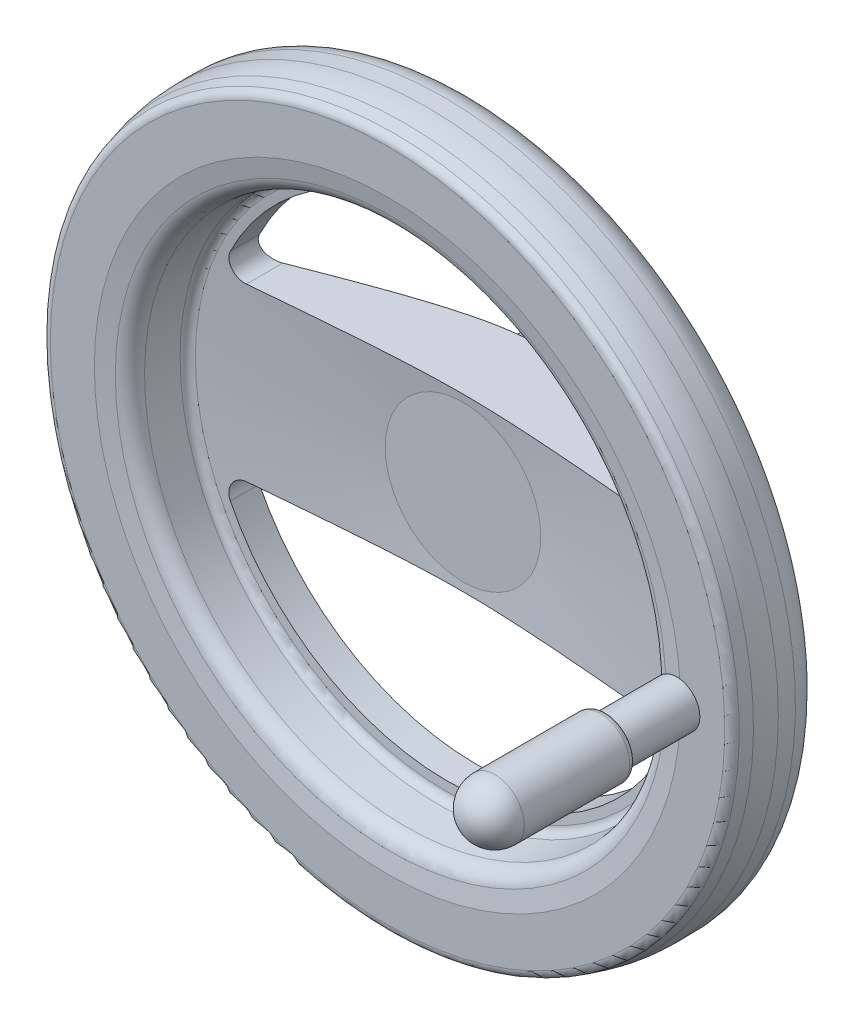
ISO-10303-21;
HEADER;
FILE_DESCRIPTION(('STEP AP214'),'2;1');
FILE_NAME('part.step','',(''),(''),'','','');
FILE_SCHEMA(('AUTOMOTIVE_DESIGN { 1 0 10303 214 1 1 1 1 }'));
ENDSEC;
DATA;
#1=APPLICATION_CONTEXT('core data for automotive mechanical design processes');
#2=APPLICATION_PROTOCOL_DEFINITION('international standard','automotive_design',2000,#1);
#3=PRODUCT_CONTEXT('',#1,'mechanical');
#4=PRODUCT('Part','Part','',(#3));
#5=PRODUCT_RELATED_PRODUCT_CATEGORY('part','',(#4));
#6=PRODUCT_DEFINITION_FORMATION('','',#4);
#7=PRODUCT_DEFINITION_CONTEXT('part definition',#1,'design');
#8=PRODUCT_DEFINITION('design','',#6,#7);
#9=PRODUCT_DEFINITION_SHAPE('','',#8);
#10=(LENGTH_UNIT() NAMED_UNIT(*) SI_UNIT(.MILLI.,.METRE.));
#11=(NAMED_UNIT(*) PLANE_ANGLE_UNIT() SI_UNIT($,.RADIAN.));
#12=(NAMED_UNIT(*) SI_UNIT($,.STERADIAN.) SOLID_ANGLE_UNIT());
#13=UNCERTAINTY_MEASURE_WITH_UNIT(LENGTH_MEASURE(1.E-05),#10,'distance_accuracy_value','');
#14=(GEOMETRIC_REPRESENTATION_CONTEXT(3) GLOBAL_UNCERTAINTY_ASSIGNED_CONTEXT((#13)) GLOBAL_UNIT_ASSIGNED_CONTEXT((#10,
#11,#12)) REPRESENTATION_CONTEXT('',''));
#15=CARTESIAN_POINT('',(0.,0.,0.));
#16=DIRECTION('',(0.,0.,1.));
#17=DIRECTION('',(1.,0.,0.));
#18=AXIS2_PLACEMENT_3D('',#15,#16,#17);
#19=CARTESIAN_POINT('',(123.,0.,63.));
#20=DIRECTION('',(0.,0.,1.));
#21=DIRECTION('',(0.,-1.,0.));
#22=AXIS2_PLACEMENT_3D('',#19,#20,#21);
#23=CYLINDRICAL_SURFACE('',#22,4.188);
#24=CARTESIAN_POINT('',(123.,0.,61.1079999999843));
#25=DIRECTION('',(0.,0.,1.));
#26=DIRECTION('',(0.,-1.,0.));
#27=AXIS2_PLACEMENT_3D('',#24,#25,#26);
#28=CIRCLE('',#27,4.188);
#29=CARTESIAN_POINT('',(123.,-4.18799999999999,61.1079999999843));
#30=VERTEX_POINT('',#29);
#31=EDGE_CURVE('E9',#30,#30,#28,.F.);
#32=ORIENTED_EDGE('',*,*,#31,.F.);
#33=EDGE_LOOP('',(#32));
#34=FACE_BOUND('',#33,.T.);
#35=CARTESIAN_POINT('',(123.,0.,48.8120000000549));
#36=DIRECTION('',(0.,0.,-1.));
#37=DIRECTION('',(-1.,0.,0.));
#38=AXIS2_PLACEMENT_3D('',#35,#36,#37);
#39=CIRCLE('',#38,4.1879999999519);
#40=CARTESIAN_POINT('',(118.812000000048,0.,48.8120000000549));
#41=VERTEX_POINT('',#40);
#42=EDGE_CURVE('E407',#41,#41,#39,.T.);
#43=ORIENTED_EDGE('',*,*,#42,.T.);
#44=EDGE_LOOP('',(#43));
#45=FACE_BOUND('',#44,.T.);
#46=ADVANCED_FACE('F14',(#34,#45),#23,.F.);
#47=CARTESIAN_POINT('',(123.,0.,48.0000000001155));
#48=DIRECTION('',(0.,0.,-1.));
#49=DIRECTION('',(0.,1.,0.));
#50=AXIS2_PLACEMENT_3D('',#47,#48,#49);
#51=CONICAL_SURFACE('',#50,4.99999999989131,0.785398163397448);
#52=CARTESIAN_POINT('',(123.,0.,48.0000000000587));
#53=DIRECTION('',(0.,0.,-1.));
#54=DIRECTION('',(0.,1.,0.));
#55=AXIS2_PLACEMENT_3D('',#52,#53,#54);
#56=CIRCLE('',#55,4.99999999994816);
#57=CARTESIAN_POINT('',(123.,4.99999999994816,48.0000000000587));
#58=VERTEX_POINT('',#57);
#59=EDGE_CURVE('E343',#58,#58,#56,.T.);
#60=ORIENTED_EDGE('',*,*,#59,.T.);
#61=EDGE_LOOP('',(#60));
#62=FACE_BOUND('',#61,.T.);
#63=ORIENTED_EDGE('',*,*,#42,.F.);
#64=EDGE_LOOP('',(#63));
#65=FACE_BOUND('',#64,.T.);
#66=ADVANCED_FACE('F1350',(#62,#65),#51,.F.);
#67=CARTESIAN_POINT('',(117.166666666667,0.,48.));
#68=DIRECTION('',(0.,0.,1.));
#69=DIRECTION('',(0.,-1.,0.));
#70=AXIS2_PLACEMENT_3D('',#67,#68,#69);
#71=PLANE('',#70);
#72=ORIENTED_EDGE('',*,*,#59,.F.);
#73=EDGE_LOOP('',(#72));
#74=FACE_BOUND('',#73,.T.);
#75=CARTESIAN_POINT('',(123.,0.,48.));
#76=DIRECTION('',(0.,0.,1.));
#77=DIRECTION('',(0.,-1.,0.));
#78=AXIS2_PLACEMENT_3D('',#75,#76,#77);
#79=CIRCLE('',#78,6.66666666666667);
#80=CARTESIAN_POINT('',(123.,-6.66666666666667,48.));
#81=VERTEX_POINT('',#80);
#82=EDGE_CURVE('E210',#81,#81,#79,.F.);
#83=ORIENTED_EDGE('',*,*,#82,.T.);
#84=EDGE_LOOP('',(#83));
#85=FACE_BOUND('',#84,.T.);
#86=ADVANCED_FACE('F246',(#74,#85),#71,.F.);
#87=CARTESIAN_POINT('',(123.,0.,45.));
#88=DIRECTION('',(0.,0.,1.));
#89=DIRECTION('',(0.,-1.,0.));
#90=AXIS2_PLACEMENT_3D('',#87,#88,#89);
#91=CYLINDRICAL_SURFACE('',#90,6.66666666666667);
#92=CARTESIAN_POINT('',(123.,0.,42.));
#93=DIRECTION('',(0.,0.,1.));
#94=DIRECTION('',(0.,-1.,0.));
#95=AXIS2_PLACEMENT_3D('',#92,#93,#94);
#96=CIRCLE('',#95,6.66666666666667);
#97=CARTESIAN_POINT('',(123.,-6.66666666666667,42.));
#98=VERTEX_POINT('',#97);
#99=EDGE_CURVE('E205',#98,#98,#96,.T.);
#100=ORIENTED_EDGE('',*,*,#99,.F.);
#101=EDGE_LOOP('',(#100));
#102=FACE_BOUND('',#101,.T.);
#103=ORIENTED_EDGE('',*,*,#82,.F.);
#104=EDGE_LOOP('',(#103));
#105=FACE_BOUND('',#104,.T.);
#106=ADVANCED_FACE('F588',(#102,#105),#91,.F.);
#107=CARTESIAN_POINT('',(-122.475216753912,0.,42.));
#108=DIRECTION('',(0.,0.,-1.));
#109=DIRECTION('',(0.,1.,0.));
#110=AXIS2_PLACEMENT_3D('',#107,#108,#109);
#111=PLANE('',#110);
#112=CARTESIAN_POINT('',(0.,0.,42.));
#113=DIRECTION('',(0.,0.,1.));
#114=DIRECTION('',(0.,-1.,0.));
#115=AXIS2_PLACEMENT_3D('',#112,#113,#114);
#116=CIRCLE('',#115,137.);
#117=CARTESIAN_POINT('',(0.,137.,42.));
#118=VERTEX_POINT('',#117);
#119=CARTESIAN_POINT('',(0.,-137.,42.));
#120=VERTEX_POINT('',#119);
#121=EDGE_CURVE('E624',#118,#120,#116,.F.);
#122=ORIENTED_EDGE('',*,*,#121,.T.);
#123=CARTESIAN_POINT('',(0.,0.,42.));
#124=DIRECTION('',(0.,0.,1.));
#125=DIRECTION('',(-1.,0.,0.));
#126=AXIS2_PLACEMENT_3D('',#123,#124,#125);
#127=CIRCLE('',#126,137.);
#128=CARTESIAN_POINT('',(-137.,0.,42.));
#129=VERTEX_POINT('',#128);
#130=EDGE_CURVE('E512',#120,#129,#127,.F.);
#131=ORIENTED_EDGE('',*,*,#130,.T.);
#132=CARTESIAN_POINT('',(0.,0.,42.));
#133=DIRECTION('',(0.,0.,1.));
#134=DIRECTION('',(0.,1.,0.));
#135=AXIS2_PLACEMENT_3D('',#132,#133,#134);
#136=CIRCLE('',#135,137.);
#137=EDGE_CURVE('E632',#129,#118,#136,.F.);
#138=ORIENTED_EDGE('',*,*,#137,.T.);
#139=EDGE_LOOP('',(#122,#131,#138));
#140=FACE_BOUND('',#139,.T.);
#141=CARTESIAN_POINT('',(0.,0.,42.0000000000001));
#142=DIRECTION('',(0.,0.,-1.));
#143=DIRECTION('',(0.,-1.,0.));
#144=AXIS2_PLACEMENT_3D('',#141,#142,#143);
#145=CIRCLE('',#144,107.950433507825);
#146=CARTESIAN_POINT('',(-107.950433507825,0.,42.));
#147=VERTEX_POINT('',#146);
#148=CARTESIAN_POINT('',(0.,-107.950433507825,42.));
#149=VERTEX_POINT('',#148);
#150=EDGE_CURVE('E636',#147,#149,#145,.F.);
#151=ORIENTED_EDGE('',*,*,#150,.T.);
#152=CARTESIAN_POINT('',(0.,0.,42.0000000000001));
#153=DIRECTION('',(0.,0.,-1.));
#154=DIRECTION('',(0.,1.,0.));
#155=AXIS2_PLACEMENT_3D('',#152,#153,#154);
#156=CIRCLE('',#155,107.950433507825);
#157=CARTESIAN_POINT('',(0.,107.950433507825,42.));
#158=VERTEX_POINT('',#157);
#159=EDGE_CURVE('E635',#149,#158,#156,.F.);
#160=ORIENTED_EDGE('',*,*,#159,.T.);
#161=CARTESIAN_POINT('',(0.,0.,42.0000000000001));
#162=DIRECTION('',(0.,0.,-1.));
#163=DIRECTION('',(-1.,0.,0.));
#164=AXIS2_PLACEMENT_3D('',#161,#162,#163);
#165=CIRCLE('',#164,107.950433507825);
#166=EDGE_CURVE('E208',#158,#147,#165,.F.);
#167=ORIENTED_EDGE('',*,*,#166,.T.);
#168=EDGE_LOOP('',(#151,#160,#167));
#169=FACE_BOUND('',#168,.T.);
#170=ORIENTED_EDGE('',*,*,#99,.T.);
#171=EDGE_LOOP('',(#170));
#172=FACE_BOUND('',#171,.T.);
#173=ADVANCED_FACE('F578',(#140,#169,#172),#111,.T.);
#174=CARTESIAN_POINT('',(123.,0.,74.4));
#175=DIRECTION('',(0.,0.,-1.));
#176=DIRECTION('',(0.,1.,0.));
#177=AXIS2_PLACEMENT_3D('',#174,#175,#176);
#178=TOROIDAL_SURFACE('',#177,6.4,3.6);
#179=CARTESIAN_POINT('',(116.615154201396,-6.61897588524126,76.6669662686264));
#180=CARTESIAN_POINT('',(116.781148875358,-6.74478795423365,76.6974460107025));
#181=CARTESIAN_POINT('',(116.95225940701,-6.86368687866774,76.7287872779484));
#182=CARTESIAN_POINT('',(117.303722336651,-7.08665798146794,76.7929870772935));
#183=CARTESIAN_POINT('',(117.484079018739,-7.1907232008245,76.8258463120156));
#184=CARTESIAN_POINT('',(117.85373382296,-7.38334799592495,76.8930011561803));
#185=CARTESIAN_POINT('',(118.043069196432,-7.47183418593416,76.9273026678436));
#186=CARTESIAN_POINT('',(118.428637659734,-7.63164949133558,76.996946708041));
#187=CARTESIAN_POINT('',(118.624869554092,-7.70298156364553,77.0322890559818));
#188=CARTESIAN_POINT('',(119.020871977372,-7.82683343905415,77.1033904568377));
#189=CARTESIAN_POINT('',(119.220586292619,-7.87953702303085,77.1391416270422));
#190=CARTESIAN_POINT('',(119.623965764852,-7.96611136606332,77.2111228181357));
#191=CARTESIAN_POINT('',(119.827630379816,-7.99998469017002,77.247352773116));
#192=CARTESIAN_POINT('',(120.237165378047,-8.0478526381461,77.3199670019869));
#193=CARTESIAN_POINT('',(120.443034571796,-8.06185748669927,77.3563511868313));
#194=CARTESIAN_POINT('',(120.855163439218,-8.0689013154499,77.4289416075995));
#195=CARTESIAN_POINT('',(121.061422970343,-8.06194686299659,77.4651478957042));
#196=CARTESIAN_POINT('',(121.416720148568,-8.03068935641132,77.5272942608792));
#197=CARTESIAN_POINT('',(121.566201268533,-8.01156573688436,77.5533718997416));
#198=CARTESIAN_POINT('',(121.863058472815,-7.96087709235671,77.6050183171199));
#199=CARTESIAN_POINT('',(122.010435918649,-7.92932053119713,77.6305874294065));
#200=CARTESIAN_POINT('',(122.301293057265,-7.85318040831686,77.6809012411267));
#201=CARTESIAN_POINT('',(122.44478622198,-7.80865063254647,77.7056488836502));
#202=CARTESIAN_POINT('',(122.726741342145,-7.70557486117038,77.7541181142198));
#203=CARTESIAN_POINT('',(122.865208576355,-7.64704409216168,77.7778407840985));
#204=CARTESIAN_POINT('',(123.093225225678,-7.53496115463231,77.8167544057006));
#205=CARTESIAN_POINT('',(123.184692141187,-7.485439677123,77.8323204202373));
#206=CARTESIAN_POINT('',(123.362997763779,-7.3782475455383,77.8625661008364));
#207=CARTESIAN_POINT('',(123.449833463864,-7.32057168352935,77.8772451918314));
#208=CARTESIAN_POINT('',(123.617603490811,-7.19565049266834,77.905484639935));
#209=CARTESIAN_POINT('',(123.698495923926,-7.1283455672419,77.9190371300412));
#210=CARTESIAN_POINT('',(123.812377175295,-7.01935582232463,77.9379912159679));
#211=CARTESIAN_POINT('',(123.849099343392,-6.98168130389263,77.9440808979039));
#212=CARTESIAN_POINT('',(123.919360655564,-6.90340815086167,77.9556782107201));
#213=CARTESIAN_POINT('',(123.95290215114,-6.86281171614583,77.9611862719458));
#214=CARTESIAN_POINT('',(124.017546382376,-6.77616412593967,77.9717283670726));
#215=CARTESIAN_POINT('',(124.04842427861,-6.72993764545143,77.9767215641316));
#216=CARTESIAN_POINT('',(124.103766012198,-6.63393453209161,77.9855553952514));
#217=CARTESIAN_POINT('',(124.128265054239,-6.58417940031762,77.9894023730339));
#218=CARTESIAN_POINT('',(124.163666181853,-6.4934137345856,77.9947949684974));
#219=CARTESIAN_POINT('',(124.176420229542,-6.45316905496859,77.996671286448));
#220=CARTESIAN_POINT('',(124.195501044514,-6.37070065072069,77.9992813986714));
#221=CARTESIAN_POINT('',(124.20175294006,-6.32845960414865,78.0000019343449));
#222=CARTESIAN_POINT('',(124.203903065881,-6.28574716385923,78.));
#223=B_SPLINE_CURVE_WITH_KNOTS('',3,(#179,#180,#181,#182,#183,#184,#185,#186,#187,#188,#189,
#190,#191,#192,#193,#194,#195,#196,#197,#198,#199,#200,#201,#202,#203,#204,#205,#206,#207,#208,
#209,#210,#211,#212,#213,#214,#215,#216,#217,#218,#219,#220,#221,#222),.UNSPECIFIED.,.F.,.F.,(4,
2,2,2,2,2,2,2,2,2,2,2,2,2,2,2,2,2,2,2,2,4),(0.,0.631376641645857,1.26304851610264,
1.89762062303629,2.5320832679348,3.16009935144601,3.78802986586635,4.41563711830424,
5.04304773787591,5.50140441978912,5.9594496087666,6.41562216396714,6.87130085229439,
7.18645998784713,7.5018213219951,7.81922649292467,7.9779738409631,8.13660289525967,
8.30367542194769,8.46980533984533,8.59607876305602,8.72379063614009),.UNSPECIFIED.);
#224=CARTESIAN_POINT('',(116.615154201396,-6.61897588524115,76.6669662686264));
#225=VERTEX_POINT('',#224);
#226=CARTESIAN_POINT('',(124.203903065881,-6.28574716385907,78.));
#227=VERTEX_POINT('',#226);
#228=EDGE_CURVE('E136',#225,#227,#223,.T.);
#229=ORIENTED_EDGE('',*,*,#228,.T.);
#230=CARTESIAN_POINT('',(123.,0.,78.));
#231=DIRECTION('',(0.,0.,-1.));
#232=DIRECTION('',(0.188109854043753,-0.982147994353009,0.));
#233=AXIS2_PLACEMENT_3D('',#230,#231,#232);
#234=CIRCLE('',#233,6.39999999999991);
#235=CARTESIAN_POINT('',(123.,-6.4,78.));
#236=VERTEX_POINT('',#235);
#237=EDGE_CURVE('E31',#227,#236,#234,.T.);
#238=ORIENTED_EDGE('',*,*,#237,.T.);
#239=CARTESIAN_POINT('',(123.,0.,78.));
#240=DIRECTION('',(0.,0.,-1.));
#241=DIRECTION('',(0.,-1.,0.));
#242=AXIS2_PLACEMENT_3D('',#239,#240,#241);
#243=CIRCLE('',#242,6.40000000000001);
#244=CARTESIAN_POINT('',(123.,6.4,78.));
#245=VERTEX_POINT('',#244);
#246=EDGE_CURVE('E439',#236,#245,#243,.T.);
#247=ORIENTED_EDGE('',*,*,#246,.T.);
#248=CARTESIAN_POINT('',(123.,0.,78.));
#249=DIRECTION('',(0.,0.,-1.));
#250=DIRECTION('',(0.,1.,0.));
#251=AXIS2_PLACEMENT_3D('',#248,#249,#250);
#252=CIRCLE('',#251,6.40000000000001);
#253=CARTESIAN_POINT('',(124.20390306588,6.28574716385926,78.));
#254=VERTEX_POINT('',#253);
#255=EDGE_CURVE('E148',#245,#254,#252,.T.);
#256=ORIENTED_EDGE('',*,*,#255,.T.);
#257=CARTESIAN_POINT('',(124.203903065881,6.28574716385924,78.));
#258=CARTESIAN_POINT('',(124.201506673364,6.33317815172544,78.0000005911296));
#259=CARTESIAN_POINT('',(124.194078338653,6.37996425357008,77.9991143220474));
#260=CARTESIAN_POINT('',(124.171365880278,6.47087898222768,77.9959433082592));
#261=CARTESIAN_POINT('',(124.156196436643,6.51503617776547,77.9936788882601));
#262=CARTESIAN_POINT('',(124.111336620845,6.62130886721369,77.9867684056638));
#263=CARTESIAN_POINT('',(124.078171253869,6.68186457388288,77.9815008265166));
#264=CARTESIAN_POINT('',(124.003207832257,6.79771506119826,77.9694104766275));
#265=CARTESIAN_POINT('',(123.961337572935,6.85295979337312,77.9625746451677));
#266=CARTESIAN_POINT('',(123.875657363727,6.95361964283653,77.9484779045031));
#267=CARTESIAN_POINT('',(123.832337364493,6.99947187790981,77.9413064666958));
#268=CARTESIAN_POINT('',(123.742002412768,7.08729881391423,77.9262834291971));
#269=CARTESIAN_POINT('',(123.69498440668,7.12927024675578,77.9184312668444));
#270=CARTESIAN_POINT('',(123.598185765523,7.2095868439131,77.902211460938));
#271=CARTESIAN_POINT('',(123.548409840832,7.24793790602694,77.8938446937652));
#272=CARTESIAN_POINT('',(123.446579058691,7.32138547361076,77.8766829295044));
#273=CARTESIAN_POINT('',(123.394523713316,7.35648127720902,77.8678878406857));
#274=CARTESIAN_POINT('',(123.286372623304,7.42502078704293,77.8495748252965));
#275=CARTESIAN_POINT('',(123.230198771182,7.45833692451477,77.8400420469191));
#276=CARTESIAN_POINT('',(123.116248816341,7.52184612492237,77.820666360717));
#277=CARTESIAN_POINT('',(123.058474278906,7.55204211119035,77.8108237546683));
#278=CARTESIAN_POINT('',(122.86409722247,7.64759288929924,77.7776511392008));
#279=CARTESIAN_POINT('',(122.724414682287,7.70655854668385,77.7537194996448));
#280=CARTESIAN_POINT('',(122.439963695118,7.81027714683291,77.704818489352));
#281=CARTESIAN_POINT('',(122.295189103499,7.85501221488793,77.6798478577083));
#282=CARTESIAN_POINT('',(122.001560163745,7.93139683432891,77.6290494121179));
#283=CARTESIAN_POINT('',(121.852688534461,7.96297723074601,77.6032178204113));
#284=CARTESIAN_POINT('',(121.553012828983,8.01346116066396,77.5510734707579));
#285=CARTESIAN_POINT('',(121.402209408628,8.03236888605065,77.5247608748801));
#286=CARTESIAN_POINT('',(120.900215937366,8.0751217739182,77.4369387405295));
#287=CARTESIAN_POINT('',(120.54664040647,8.07268413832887,77.3747062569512));
#288=CARTESIAN_POINT('',(119.845753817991,8.00914746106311,77.2506491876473));
#289=CARTESIAN_POINT('',(119.498435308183,7.94812365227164,77.1888241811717));
#290=CARTESIAN_POINT('',(118.812986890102,7.77159936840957,77.0661744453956));
#291=CARTESIAN_POINT('',(118.475030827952,7.65541356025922,77.0053725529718));
#292=CARTESIAN_POINT('',(117.820084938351,7.37346869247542,76.8869653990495));
#293=CARTESIAN_POINT('',(117.503082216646,7.20774047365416,76.8293581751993));
#294=CARTESIAN_POINT('',(117.099109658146,6.95787894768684,76.7556202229));
#295=CARTESIAN_POINT('',(117.000033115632,6.89326514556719,76.7375074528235));
#296=CARTESIAN_POINT('',(116.80515887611,6.759500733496,76.701829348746));
#297=CARTESIAN_POINT('',(116.709355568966,6.6903585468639,76.6842630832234));
#298=CARTESIAN_POINT('',(116.615154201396,6.61897588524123,76.6669662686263));
#299=B_SPLINE_CURVE_WITH_KNOTS('',3,(#257,#258,#259,#260,#261,#262,#263,#264,#265,#266,#267,
#268,#269,#270,#271,#272,#273,#274,#275,#276,#277,#278,#279,#280,#281,#282,#283,#284,#285,#286,
#287,#288,#289,#290,#291,#292,#293,#294,#295,#296,#297,#298),.UNSPECIFIED.,.F.,.F.,(4,2,2,2,2,2,
2,2,2,2,2,2,2,2,2,2,2,2,2,2,4),(0.,0.141631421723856,0.281223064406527,0.487852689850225,
0.696270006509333,0.886458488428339,1.07680569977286,1.26683727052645,1.45690971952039,
1.65481019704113,1.85252354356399,2.31203828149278,2.77212794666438,3.2346067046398,
3.69693240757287,4.76803966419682,5.83777330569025,6.92115971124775,8.00387309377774,
8.36276901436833,8.72101533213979),.UNSPECIFIED.);
#300=CARTESIAN_POINT('',(116.615154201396,6.61897588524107,76.6669662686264));
#301=VERTEX_POINT('',#300);
#302=EDGE_CURVE('E134',#254,#301,#299,.T.);
#303=ORIENTED_EDGE('',*,*,#302,.T.);
#304=CARTESIAN_POINT('',(116.615154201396,6.61897588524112,76.6669662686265));
#305=CARTESIAN_POINT('',(116.544334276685,6.56530451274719,76.6539639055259));
#306=CARTESIAN_POINT('',(116.473951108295,6.51133333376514,76.6398517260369));
#307=CARTESIAN_POINT('',(116.334195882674,6.40268472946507,76.6094918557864));
#308=CARTESIAN_POINT('',(116.264823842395,6.34800729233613,76.5932441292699));
#309=CARTESIAN_POINT('',(116.058270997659,6.18262755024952,76.5413835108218));
#310=CARTESIAN_POINT('',(115.922822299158,6.0707047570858,76.5026844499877));
#311=CARTESIAN_POINT('',(115.657740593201,5.84269373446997,76.417964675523));
#312=CARTESIAN_POINT('',(115.528110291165,5.72660361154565,76.3719406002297));
#313=CARTESIAN_POINT('',(115.27551662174,5.48900912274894,76.2735923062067));
#314=CARTESIAN_POINT('',(115.152577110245,5.36748788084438,76.2212474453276));
#315=CARTESIAN_POINT('',(114.915069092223,5.11867361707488,76.1118592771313));
#316=CARTESIAN_POINT('',(114.800495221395,4.99138438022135,76.0548190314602));
#317=CARTESIAN_POINT('',(114.58070174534,4.73038918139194,75.9377128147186));
#318=CARTESIAN_POINT('',(114.475477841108,4.59668621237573,75.8776482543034));
#319=CARTESIAN_POINT('',(114.26409374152,4.30721769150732,75.7496191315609));
#320=CARTESIAN_POINT('',(114.159114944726,4.1506467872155,75.6815150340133));
#321=CARTESIAN_POINT('',(113.962522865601,3.82878513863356,75.5465646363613));
#322=CARTESIAN_POINT('',(113.870909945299,3.66349415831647,75.4797183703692));
#323=CARTESIAN_POINT('',(113.701879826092,3.32499862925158,75.3503044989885));
#324=CARTESIAN_POINT('',(113.624413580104,3.1518241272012,75.2877226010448));
#325=CARTESIAN_POINT('',(113.483500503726,2.79764402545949,75.169246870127));
#326=CARTESIAN_POINT('',(113.420053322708,2.61663862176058,75.1133528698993));
#327=CARTESIAN_POINT('',(113.306723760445,2.24642677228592,75.0102837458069));
#328=CARTESIAN_POINT('',(113.256945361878,2.05716950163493,74.9631762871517));
#329=CARTESIAN_POINT('',(113.171374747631,1.67307620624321,74.8802618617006));
#330=CARTESIAN_POINT('',(113.135583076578,1.47823996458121,74.8444553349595));
#331=CARTESIAN_POINT('',(113.077689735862,1.08440289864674,74.7856702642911));
#332=CARTESIAN_POINT('',(113.055603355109,0.885397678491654,74.7627060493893));
#333=CARTESIAN_POINT('',(113.024961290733,0.48524656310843,74.7306610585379));
#334=CARTESIAN_POINT('',(113.016404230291,0.284100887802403,74.72157886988));
#335=CARTESIAN_POINT('',(113.012919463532,-0.0963450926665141,74.7178885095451));
#336=CARTESIAN_POINT('',(113.016599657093,-0.275621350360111,74.7218019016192));
#337=CARTESIAN_POINT('',(113.034636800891,-0.633029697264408,74.740791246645));
#338=CARTESIAN_POINT('',(113.048992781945,-0.811161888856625,74.7558661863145));
#339=CARTESIAN_POINT('',(113.088492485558,-1.16487644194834,74.7966535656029));
#340=CARTESIAN_POINT('',(113.113629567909,-1.34046030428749,74.8223594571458));
#341=CARTESIAN_POINT('',(113.174870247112,-1.68797442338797,74.8835260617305));
#342=CARTESIAN_POINT('',(113.210973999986,-1.85990462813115,74.9189869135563));
#343=CARTESIAN_POINT('',(113.293800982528,-2.19686884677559,74.9979305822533));
#344=CARTESIAN_POINT('',(113.340383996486,-2.36196260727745,75.0413061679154));
#345=CARTESIAN_POINT('',(113.444534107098,-2.68664066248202,75.134893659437));
#346=CARTESIAN_POINT('',(113.502100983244,-2.84622506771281,75.1851054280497));
#347=CARTESIAN_POINT('',(113.628215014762,-3.15919146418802,75.2906564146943));
#348=CARTESIAN_POINT('',(113.696760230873,-3.31257454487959,75.3459947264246));
#349=CARTESIAN_POINT('',(113.844686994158,-3.61274196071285,75.45995723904));
#350=CARTESIAN_POINT('',(113.924068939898,-3.75952605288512,75.5185815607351));
#351=CARTESIAN_POINT('',(114.101704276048,-4.06049573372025,75.6430660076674));
#352=CARTESIAN_POINT('',(114.201047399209,-4.21397897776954,75.7090686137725));
#353=CARTESIAN_POINT('',(114.411697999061,-4.51288367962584,75.8402209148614));
#354=CARTESIAN_POINT('',(114.523006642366,-4.65830434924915,75.905370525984));
#355=CARTESIAN_POINT('',(114.756701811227,-4.94169216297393,76.0325182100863));
#356=CARTESIAN_POINT('',(114.879100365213,-5.07965094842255,76.0945127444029));
#357=CARTESIAN_POINT('',(115.133611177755,-5.34870094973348,76.213141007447));
#358=CARTESIAN_POINT('',(115.265722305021,-5.47979296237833,76.2697753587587));
#359=CARTESIAN_POINT('',(115.496594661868,-5.69696178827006,76.3596722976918));
#360=CARTESIAN_POINT('',(115.593219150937,-5.78455947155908,76.3947904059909));
#361=CARTESIAN_POINT('',(115.789943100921,-5.95729955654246,76.4610659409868));
#362=CARTESIAN_POINT('',(115.890042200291,-6.04244221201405,76.4922237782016));
#363=CARTESIAN_POINT('',(116.092931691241,-6.21043901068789,76.5500709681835));
#364=CARTESIAN_POINT('',(116.195714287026,-6.29329859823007,76.5767718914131));
#365=CARTESIAN_POINT('',(116.403726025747,-6.457321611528,76.6254757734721));
#366=CARTESIAN_POINT('',(116.50895528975,-6.53848495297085,76.6474784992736));
#367=CARTESIAN_POINT('',(116.615154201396,-6.61897588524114,76.6669662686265));
#368=B_SPLINE_CURVE_WITH_KNOTS('',3,(#304,#305,#306,#307,#308,#309,#310,#311,#312,#313,#314,
#315,#316,#317,#318,#319,#320,#321,#322,#323,#324,#325,#326,#327,#328,#329,#330,#331,#332,#333,
#334,#335,#336,#337,#338,#339,#340,#341,#342,#343,#344,#345,#346,#347,#348,#349,#350,#351,#352,
#353,#354,#355,#356,#357,#358,#359,#360,#361,#362,#363,#364,#365,#366,#367),.UNSPECIFIED.,.F.,
.F.,(4,2,2,2,2,2,2,2,2,2,2,2,2,2,2,2,2,2,2,2,2,2,2,2,2,2,2,2,2,2,2,4),(0.,0.269400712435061,
0.538805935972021,1.0782560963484,1.61795454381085,2.15946577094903,2.70062665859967,
3.24153742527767,3.84222000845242,4.4429188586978,5.04149379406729,5.64005375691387,
6.24304837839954,6.84606647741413,7.44975606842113,8.05338422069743,8.59079763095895,
9.12816225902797,9.66519639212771,10.2022381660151,10.7324816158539,11.2627144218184,
11.7928536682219,12.3230124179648,12.9055701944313,13.4881848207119,14.0714391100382,
14.6546255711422,15.0597080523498,15.4647485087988,15.8687205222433,16.2727125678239),.UNSPECIFIED.);
#369=EDGE_CURVE('E140',#301,#225,#368,.T.);
#370=ORIENTED_EDGE('',*,*,#369,.T.);
#371=EDGE_LOOP('',(#229,#238,#247,#256,#303,#370));
#372=FACE_BOUND('',#371,.T.);
#373=ADVANCED_FACE('F145',(#372),#178,.T.);
#374=CARTESIAN_POINT('',(-133.692544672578,0.,78.));
#375=DIRECTION('',(0.,0.,1.));
#376=DIRECTION('',(0.,-1.,0.));
#377=AXIS2_PLACEMENT_3D('',#374,#375,#376);
#378=PLANE('',#377);
#379=CARTESIAN_POINT('',(0.,0.,78.));
#380=DIRECTION('',(0.,0.,1.));
#381=DIRECTION('',(0.,-1.,0.));
#382=AXIS2_PLACEMENT_3D('',#379,#380,#381);
#383=CIRCLE('',#382,124.362856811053);
#384=CARTESIAN_POINT('',(124.153038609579,-7.22102196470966,78.));
#385=VERTEX_POINT('',#384);
#386=CARTESIAN_POINT('',(124.153038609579,7.22102196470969,78.));
#387=VERTEX_POINT('',#386);
#388=EDGE_CURVE('E167',#385,#387,#383,.F.);
#389=ORIENTED_EDGE('',*,*,#388,.T.);
#390=CARTESIAN_POINT('',(123.,0.,78.));
#391=DIRECTION('',(0.,0.,1.));
#392=DIRECTION('',(0.,-1.,0.));
#393=AXIS2_PLACEMENT_3D('',#390,#391,#392);
#394=CIRCLE('',#393,7.3125);
#395=EDGE_CURVE('E519',#385,#387,#394,.T.);
#396=ORIENTED_EDGE('',*,*,#395,.F.);
#397=EDGE_LOOP('',(#389,#396));
#398=FACE_BOUND('',#397,.T.);
#399=CARTESIAN_POINT('',(0.,0.,78.));
#400=DIRECTION('',(0.,0.,-1.));
#401=DIRECTION('',(0.,-1.,0.));
#402=AXIS2_PLACEMENT_3D('',#399,#400,#401);
#403=CIRCLE('',#402,143.022232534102);
#404=CARTESIAN_POINT('',(0.,-143.022232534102,78.));
#405=VERTEX_POINT('',#404);
#406=CARTESIAN_POINT('',(-143.022232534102,0.,78.));
#407=VERTEX_POINT('',#406);
#408=EDGE_CURVE('E1117',#405,#407,#403,.T.);
#409=ORIENTED_EDGE('',*,*,#408,.F.);
#410=CARTESIAN_POINT('',(0.,0.,78.));
#411=DIRECTION('',(0.,0.,-1.));
#412=DIRECTION('',(0.,1.,0.));
#413=AXIS2_PLACEMENT_3D('',#410,#411,#412);
#414=CIRCLE('',#413,143.022232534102);
#415=CARTESIAN_POINT('',(0.,143.022232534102,78.));
#416=VERTEX_POINT('',#415);
#417=EDGE_CURVE('E1119',#416,#405,#414,.T.);
#418=ORIENTED_EDGE('',*,*,#417,.F.);
#419=CARTESIAN_POINT('',(0.,0.,78.));
#420=DIRECTION('',(0.,0.,-1.));
#421=DIRECTION('',(-1.,0.,0.));
#422=AXIS2_PLACEMENT_3D('',#419,#420,#421);
#423=CIRCLE('',#422,143.022232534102);
#424=EDGE_CURVE('E1118',#407,#416,#423,.T.);
#425=ORIENTED_EDGE('',*,*,#424,.F.);
#426=EDGE_LOOP('',(#409,#418,#425));
#427=FACE_BOUND('',#426,.T.);
#428=ADVANCED_FACE('F176',(#398,#427),#378,.T.);
#429=CARTESIAN_POINT('',(0.,0.,78.));
#430=DIRECTION('',(0.,0.,1.));
#431=DIRECTION('',(0.,-1.,0.));
#432=AXIS2_PLACEMENT_3D('',#429,#430,#431);
#433=CONICAL_SURFACE('',#432,124.362856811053,1.39626340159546);
#434=CARTESIAN_POINT('',(0.,0.,76.6669662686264));
#435=DIRECTION('',(0.,0.,1.));
#436=DIRECTION('',(-1.,0.,0.));
#437=AXIS2_PLACEMENT_3D('',#434,#435,#436);
#438=CIRCLE('',#437,116.802846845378);
#439=EDGE_CURVE('E127',#301,#225,#438,.T.);
#440=ORIENTED_EDGE('',*,*,#439,.F.);
#441=ORIENTED_EDGE('',*,*,#302,.F.);
#442=CARTESIAN_POINT('',(0.,0.,78.));
#443=DIRECTION('',(0.,0.,-1.));
#444=DIRECTION('',(0.,1.,0.));
#445=AXIS2_PLACEMENT_3D('',#442,#443,#444);
#446=CIRCLE('',#445,124.362856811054);
#447=EDGE_CURVE('E23',#387,#254,#446,.T.);
#448=ORIENTED_EDGE('',*,*,#447,.F.);
#449=ORIENTED_EDGE('',*,*,#388,.F.);
#450=EDGE_CURVE('E444',#227,#385,#446,.T.);
#451=ORIENTED_EDGE('',*,*,#450,.F.);
#452=ORIENTED_EDGE('',*,*,#228,.F.);
#453=EDGE_LOOP('',(#440,#441,#448,#449,#451,#452));
#454=FACE_BOUND('',#453,.T.);
#455=ADVANCED_FACE('F131',(#454),#433,.F.);
#456=CARTESIAN_POINT('',(0.,0.,74.4));
#457=DIRECTION('',(0.,0.,-1.));
#458=DIRECTION('',(0.,1.,0.));
#459=AXIS2_PLACEMENT_3D('',#456,#457,#458);
#460=TOROIDAL_SURFACE('',#459,143.022232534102,3.6);
#461=CARTESIAN_POINT('',(0.,0.,75.3317485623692));
#462=DIRECTION('',(0.,0.,-1.));
#463=DIRECTION('',(-1.,0.,0.));
#464=AXIS2_PLACEMENT_3D('',#461,#462,#463);
#465=CIRCLE('',#464,146.499565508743);
#466=CARTESIAN_POINT('',(-146.499565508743,0.,75.3317485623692));
#467=VERTEX_POINT('',#466);
#468=EDGE_CURVE('E396',#467,#467,#465,.T.);
#469=ORIENTED_EDGE('',*,*,#468,.F.);
#470=EDGE_LOOP('',(#469));
#471=FACE_BOUND('',#470,.T.);
#472=ORIENTED_EDGE('',*,*,#408,.T.);
#473=ORIENTED_EDGE('',*,*,#424,.T.);
#474=ORIENTED_EDGE('',*,*,#417,.T.);
#475=EDGE_LOOP('',(#472,#473,#474));
#476=FACE_BOUND('',#475,.T.);
#477=ADVANCED_FACE('F175',(#471,#476),#460,.T.);
#478=CARTESIAN_POINT('',(0.,0.,69.5763504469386));
#479=DIRECTION('',(0.,0.,-1.));
#480=DIRECTION('',(0.,1.,0.));
#481=AXIS2_PLACEMENT_3D('',#478,#479,#480);
#482=TOROIDAL_SURFACE('',#481,118.05311372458,7.2);
#483=CARTESIAN_POINT('',(0.,0.,70.2038717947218));
#484=DIRECTION('',(0.,0.,1.));
#485=DIRECTION('',(-1.,0.,0.));
#486=AXIS2_PLACEMENT_3D('',#483,#484,#485);
#487=CIRCLE('',#486,110.880511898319);
#488=CARTESIAN_POINT('',(-110.880511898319,0.,70.2038717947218));
#489=VERTEX_POINT('',#488);
#490=EDGE_CURVE('E194',#489,#489,#487,.F.);
#491=ORIENTED_EDGE('',*,*,#490,.T.);
#492=EDGE_LOOP('',(#491));
#493=FACE_BOUND('',#492,.T.);
#494=ORIENTED_EDGE('',*,*,#369,.F.);
#495=ORIENTED_EDGE('',*,*,#439,.T.);
#496=EDGE_LOOP('',(#494,#495));
#497=FACE_BOUND('',#496,.T.);
#498=ADVANCED_FACE('F141',(#493,#497),#482,.T.);
#499=CARTESIAN_POINT('',(0.,0.,70.5779957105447));
#500=DIRECTION('',(0.,0.,-1.));
#501=DIRECTION('',(0.,1.,0.));
#502=AXIS2_PLACEMENT_3D('',#499,#500,#501);
#503=CONICAL_SURFACE('',#502,147.773329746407,0.261799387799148);
#504=CARTESIAN_POINT('',(0.,0.,70.5779957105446));
#505=DIRECTION('',(0.,0.,-1.));
#506=DIRECTION('',(0.,1.,0.));
#507=AXIS2_PLACEMENT_3D('',#504,#505,#506);
#508=CIRCLE('',#507,147.773329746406);
#509=CARTESIAN_POINT('',(0.,147.773329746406,70.5779957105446));
#510=VERTEX_POINT('',#509);
#511=EDGE_CURVE('E341',#510,#510,#508,.T.);
#512=ORIENTED_EDGE('',*,*,#511,.F.);
#513=EDGE_LOOP('',(#512));
#514=FACE_BOUND('',#513,.T.);
#515=ORIENTED_EDGE('',*,*,#468,.T.);
#516=EDGE_LOOP('',(#515));
#517=FACE_BOUND('',#516,.T.);
#518=ADVANCED_FACE('F182',(#514,#517),#503,.T.);
#519=CARTESIAN_POINT('',(0.,0.,70.2038717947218));
#520=DIRECTION('',(0.,0.,1.));
#521=DIRECTION('',(0.,-1.,0.));
#522=AXIS2_PLACEMENT_3D('',#519,#520,#521);
#523=CONICAL_SURFACE('',#522,110.880511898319,0.0872664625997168);
#524=CARTESIAN_POINT('',(0.,0.,56.3565282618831));
#525=DIRECTION('',(0.,0.,-1.));
#526=DIRECTION('',(0.,1.,0.));
#527=AXIS2_PLACEMENT_3D('',#524,#525,#526);
#528=CIRCLE('',#527,109.669026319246);
#529=CARTESIAN_POINT('',(0.,109.669026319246,56.3565282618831));
#530=VERTEX_POINT('',#529);
#531=EDGE_CURVE('E1124',#530,#530,#528,.T.);
#532=ORIENTED_EDGE('',*,*,#531,.T.);
#533=EDGE_LOOP('',(#532));
#534=FACE_BOUND('',#533,.T.);
#535=ORIENTED_EDGE('',*,*,#490,.F.);
#536=EDGE_LOOP('',(#535));
#537=FACE_BOUND('',#536,.T.);
#538=ADVANCED_FACE('F687',(#534,#537),#523,.F.);
#539=CARTESIAN_POINT('',(0.,0.,61.2605100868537));
#540=DIRECTION('',(0.,0.,-1.));
#541=DIRECTION('',(0.,1.,0.));
#542=AXIS2_PLACEMENT_3D('',#539,#540,#541);
#543=TOROIDAL_SURFACE('',#542,113.,36.);
#544=ORIENTED_EDGE('',*,*,#511,.T.);
#545=EDGE_LOOP('',(#544));
#546=FACE_BOUND('',#545,.T.);
#547=CARTESIAN_POINT('',(0.,0.,61.2605100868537));
#548=DIRECTION('',(0.,0.,1.));
#549=DIRECTION('',(0.,-1.,0.));
#550=AXIS2_PLACEMENT_3D('',#547,#548,#549);
#551=CIRCLE('',#550,149.);
#552=CARTESIAN_POINT('',(0.,-149.,61.2605100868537));
#553=VERTEX_POINT('',#552);
#554=EDGE_CURVE('E214',#553,#553,#551,.F.);
#555=ORIENTED_EDGE('',*,*,#554,.F.);
#556=EDGE_LOOP('',(#555));
#557=FACE_BOUND('',#556,.T.);
#558=ADVANCED_FACE('F685',(#546,#557),#543,.T.);
#559=CARTESIAN_POINT('',(0.,0.,56.6702889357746));
#560=DIRECTION('',(0.,0.,-1.));
#561=DIRECTION('',(0.,1.,0.));
#562=AXIS2_PLACEMENT_3D('',#559,#560,#561);
#563=TOROIDAL_SURFACE('',#562,106.082725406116,3.60000000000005);
#564=CARTESIAN_POINT('',(0.,0.,53.0869398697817));
#565=DIRECTION('',(0.,0.,1.));
#566=DIRECTION('',(-1.,0.,0.));
#567=AXIS2_PLACEMENT_3D('',#564,#565,#566);
#568=CIRCLE('',#567,106.428571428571);
#569=CARTESIAN_POINT('',(-106.428571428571,0.,53.0869398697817));
#570=VERTEX_POINT('',#569);
#571=EDGE_CURVE('E393',#570,#570,#568,.F.);
#572=ORIENTED_EDGE('',*,*,#571,.T.);
#573=EDGE_LOOP('',(#572));
#574=FACE_BOUND('',#573,.T.);
#575=ORIENTED_EDGE('',*,*,#531,.F.);
#576=EDGE_LOOP('',(#575));
#577=FACE_BOUND('',#576,.T.);
#578=ADVANCED_FACE('F418',(#574,#577),#563,.F.);
#579=CARTESIAN_POINT('',(0.,0.,57.6302550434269));
#580=DIRECTION('',(0.,0.,1.));
#581=DIRECTION('',(0.,-1.,0.));
#582=AXIS2_PLACEMENT_3D('',#579,#580,#581);
#583=CYLINDRICAL_SURFACE('',#582,149.);
#584=ORIENTED_EDGE('',*,*,#554,.T.);
#585=EDGE_LOOP('',(#584));
#586=FACE_BOUND('',#585,.T.);
#587=CARTESIAN_POINT('',(0.,0.,54.));
#588=DIRECTION('',(0.,0.,-1.));
#589=DIRECTION('',(0.,1.,0.));
#590=AXIS2_PLACEMENT_3D('',#587,#588,#589);
#591=CIRCLE('',#590,149.);
#592=CARTESIAN_POINT('',(0.,149.,54.));
#593=VERTEX_POINT('',#592);
#594=EDGE_CURVE('E209',#593,#593,#591,.T.);
#595=ORIENTED_EDGE('',*,*,#594,.F.);
#596=EDGE_LOOP('',(#595));
#597=FACE_BOUND('',#596,.T.);
#598=ADVANCED_FACE('F244',(#586,#597),#583,.T.);
#599=CARTESIAN_POINT('',(0.,0.,53.0869398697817));
#600=DIRECTION('',(0.,0.,1.));
#601=DIRECTION('',(0.,-1.,0.));
#602=AXIS2_PLACEMENT_3D('',#599,#600,#601);
#603=CONICAL_SURFACE('',#602,106.428571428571,1.47457959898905);
#604=ORIENTED_EDGE('',*,*,#571,.F.);
#605=EDGE_LOOP('',(#604));
#606=FACE_BOUND('',#605,.T.);
#607=CARTESIAN_POINT('',(86.0226130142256,-36.3,51.8264003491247));
#608=CARTESIAN_POINT('',(86.2097550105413,-36.2999803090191,51.843040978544));
#609=CARTESIAN_POINT('',(86.3968660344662,-36.3079320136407,51.8599854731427));
#610=CARTESIAN_POINT('',(86.7696922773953,-36.3396217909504,51.894350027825));
#611=CARTESIAN_POINT('',(86.9554075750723,-36.3633589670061,51.9117700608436));
#612=CARTESIAN_POINT('',(87.3240065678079,-36.4264421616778,51.9469436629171));
#613=CARTESIAN_POINT('',(87.5068920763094,-36.4657777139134,51.9646970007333));
#614=CARTESIAN_POINT('',(87.8686607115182,-36.5597653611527,52.0004172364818));
#615=CARTESIAN_POINT('',(88.0475438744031,-36.6144173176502,52.0183841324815));
#616=CARTESIAN_POINT('',(88.4000833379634,-36.7386632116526,52.0544058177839));
#617=CARTESIAN_POINT('',(88.5737383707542,-36.808260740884,52.0724606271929));
#618=CARTESIAN_POINT('',(88.9146070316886,-36.9619234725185,52.1085319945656));
#619=CARTESIAN_POINT('',(89.0818182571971,-37.0459940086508,52.1265485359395));
#620=CARTESIAN_POINT('',(89.4084471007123,-37.2279371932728,52.1624001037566));
#621=CARTESIAN_POINT('',(89.5678691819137,-37.3258018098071,52.1802352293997));
#622=CARTESIAN_POINT('',(89.8779454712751,-37.5347181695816,52.2156183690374));
#623=CARTESIAN_POINT('',(90.0285964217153,-37.6457747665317,52.2331662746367));
#624=CARTESIAN_POINT('',(90.3199901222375,-37.880263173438,52.2678492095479));
#625=CARTESIAN_POINT('',(90.4607328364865,-38.0036950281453,52.2849842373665));
#626=CARTESIAN_POINT('',(90.7313502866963,-38.2621109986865,52.3187330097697));
#627=CARTESIAN_POINT('',(90.861220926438,-38.3970994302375,52.3353465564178));
#628=CARTESIAN_POINT('',(91.1090725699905,-38.6776047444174,52.3679323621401));
#629=CARTESIAN_POINT('',(91.2270560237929,-38.8231194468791,52.3839047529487));
#630=CARTESIAN_POINT('',(91.4503592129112,-39.1237392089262,52.4151145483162));
#631=CARTESIAN_POINT('',(91.5556731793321,-39.2788485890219,52.430351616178));
#632=CARTESIAN_POINT('',(91.7525878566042,-39.5971418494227,52.459951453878));
#633=CARTESIAN_POINT('',(91.8442184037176,-39.7603070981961,52.4743160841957));
#634=CARTESIAN_POINT('',(92.0133349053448,-40.0937923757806,52.5021093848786));
#635=CARTESIAN_POINT('',(92.0908273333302,-40.2641090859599,52.5155384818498));
#636=CARTESIAN_POINT('',(92.2311611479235,-40.6107868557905,52.5413852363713));
#637=CARTESIAN_POINT('',(92.2939998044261,-40.7871490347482,52.5538027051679));
#638=CARTESIAN_POINT('',(92.4045184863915,-41.1445593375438,52.5775406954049));
#639=CARTESIAN_POINT('',(92.4522042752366,-41.325605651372,52.5888616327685));
#640=CARTESIAN_POINT('',(92.5319485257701,-41.690503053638,52.6103029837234));
#641=CARTESIAN_POINT('',(92.5640617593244,-41.8743419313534,52.6204275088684));
#642=CARTESIAN_POINT('',(92.612657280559,-42.2440666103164,52.6394561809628));
#643=CARTESIAN_POINT('',(92.6291454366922,-42.4299516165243,52.6483607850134));
#644=CARTESIAN_POINT('',(92.6463834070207,-42.8026136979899,52.6649040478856));
#645=CARTESIAN_POINT('',(92.6471241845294,-42.9893912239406,52.6725419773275));
#646=CARTESIAN_POINT('',(92.6328284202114,-43.3623214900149,52.6864961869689));
#647=CARTESIAN_POINT('',(92.617797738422,-43.548474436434,52.6928129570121));
#648=CARTESIAN_POINT('',(92.571958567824,-43.91974127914,52.7041157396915));
#649=CARTESIAN_POINT('',(92.541077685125,-44.104846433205,52.7090954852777));
#650=CARTESIAN_POINT('',(92.4637147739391,-44.4718034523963,52.7176551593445));
#651=CARTESIAN_POINT('',(92.4172325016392,-44.6536552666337,52.721235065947));
#652=CARTESIAN_POINT('',(92.3089451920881,-45.0129317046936,52.7269748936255));
#653=CARTESIAN_POINT('',(92.2471270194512,-45.1903523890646,52.7291335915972));
#654=CARTESIAN_POINT('',(92.108654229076,-45.5393288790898,52.7320147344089));
#655=CARTESIAN_POINT('',(92.0319988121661,-45.7108843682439,52.7327371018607));
#656=CARTESIAN_POINT('',(91.948161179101,-45.8788598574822,52.7327355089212));
#657=B_SPLINE_CURVE_WITH_KNOTS('',3,(#607,#608,#609,#610,#611,#612,#613,#614,#615,#616,#617,
#618,#619,#620,#621,#622,#623,#624,#625,#626,#627,#628,#629,#630,#631,#632,#633,#634,#635,#636,
#637,#638,#639,#640,#641,#642,#643,#644,#645,#646,#647,#648,#649,#650,#651,#652,#653,#654,#655,
#656),.UNSPECIFIED.,.F.,.F.,(4,2,2,2,2,2,2,2,2,2,2,2,2,2,2,2,2,2,2,2,2,2,2,2,4),(0.,
0.563467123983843,1.12690224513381,1.68995994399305,2.25301255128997,2.81620062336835,
3.37959669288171,3.94266605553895,4.5059432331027,5.06922244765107,5.63271293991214,
6.19608705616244,6.75971673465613,7.32209890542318,7.88422292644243,8.44645159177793,
9.00846615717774,9.56848940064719,10.1283022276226,10.6884362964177,11.2483623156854,
11.8108687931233,12.373384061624,12.9363828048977,13.499411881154),.UNSPECIFIED.);
#658=CARTESIAN_POINT('',(86.0226130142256,-36.3,51.8264003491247));
#659=VERTEX_POINT('',#658);
#660=CARTESIAN_POINT('',(91.9481611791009,-45.8788598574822,52.7327355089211));
#661=VERTEX_POINT('',#660);
#662=EDGE_CURVE('E335',#659,#661,#657,.T.);
#663=ORIENTED_EDGE('',*,*,#662,.T.);
#664=CARTESIAN_POINT('',(0.,0.,52.7327355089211));
#665=DIRECTION('',(0.,0.,-1.));
#666=DIRECTION('',(0.,1.,0.));
#667=AXIS2_PLACEMENT_3D('',#664,#665,#666);
#668=CIRCLE('',#667,102.758620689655);
#669=CARTESIAN_POINT('',(-91.9481610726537,-45.8788600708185,52.7327355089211));
#670=VERTEX_POINT('',#669);
#671=EDGE_CURVE('E398',#661,#670,#668,.T.);
#672=ORIENTED_EDGE('',*,*,#671,.T.);
#673=CARTESIAN_POINT('',(-91.9481610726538,-45.8788600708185,52.7327355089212));
#674=CARTESIAN_POINT('',(-92.0310853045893,-45.7127131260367,52.7327370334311));
#675=CARTESIAN_POINT('',(-92.106983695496,-45.5430640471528,52.7320303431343));
#676=CARTESIAN_POINT('',(-92.2442687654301,-45.1980141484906,52.7292115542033));
#677=CARTESIAN_POINT('',(-92.3056562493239,-45.022613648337,52.7270995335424));
#678=CARTESIAN_POINT('',(-92.413426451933,-44.6674342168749,52.7214833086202));
#679=CARTESIAN_POINT('',(-92.4598209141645,-44.4876588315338,52.7179801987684));
#680=CARTESIAN_POINT('',(-92.5373530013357,-44.1248814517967,52.7096034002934));
#681=CARTESIAN_POINT('',(-92.5684907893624,-43.9418794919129,52.7047297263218));
#682=CARTESIAN_POINT('',(-92.6153020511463,-43.5739029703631,52.6936396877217));
#683=CARTESIAN_POINT('',(-92.6309717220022,-43.3889279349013,52.6874229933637));
#684=CARTESIAN_POINT('',(-92.6467366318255,-43.0182954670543,52.673682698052));
#685=CARTESIAN_POINT('',(-92.6468261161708,-42.8326378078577,52.6661586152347));
#686=CARTESIAN_POINT('',(-92.631432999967,-42.4621304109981,52.6498553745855));
#687=CARTESIAN_POINT('',(-92.6159592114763,-42.2772802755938,52.6410769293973));
#688=CARTESIAN_POINT('',(-92.5695684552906,-41.9095208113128,52.6223116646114));
#689=CARTESIAN_POINT('',(-92.5386457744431,-41.7266122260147,52.6123243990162));
#690=CARTESIAN_POINT('',(-92.461536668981,-41.3638509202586,52.5911908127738));
#691=CARTESIAN_POINT('',(-92.4153297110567,-41.1840026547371,52.5800429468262));
#692=CARTESIAN_POINT('',(-92.3079861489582,-40.8288172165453,52.5566635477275));
#693=CARTESIAN_POINT('',(-92.2468439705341,-40.6534817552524,52.544431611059));
#694=CARTESIAN_POINT('',(-92.1100999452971,-40.3086567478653,52.5189657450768));
#695=CARTESIAN_POINT('',(-92.0345007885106,-40.1391661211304,52.5057320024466));
#696=CARTESIAN_POINT('',(-91.8693467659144,-39.8071087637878,52.4783367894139));
#697=CARTESIAN_POINT('',(-91.7797855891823,-39.6445452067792,52.4641749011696));
#698=CARTESIAN_POINT('',(-91.5870046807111,-39.3269455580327,52.4349612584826));
#699=CARTESIAN_POINT('',(-91.4837334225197,-39.1719410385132,52.4199062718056));
#700=CARTESIAN_POINT('',(-91.264595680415,-38.8712923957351,52.3890595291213));
#701=CARTESIAN_POINT('',(-91.1487348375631,-38.725644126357,52.3732681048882));
#702=CARTESIAN_POINT('',(-90.905184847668,-38.4446225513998,52.341040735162));
#703=CARTESIAN_POINT('',(-90.7774933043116,-38.3092513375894,52.3246046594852));
#704=CARTESIAN_POINT('',(-90.5112610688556,-38.0498100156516,52.2912043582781));
#705=CARTESIAN_POINT('',(-90.372724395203,-37.9257357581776,52.2742403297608));
#706=CARTESIAN_POINT('',(-90.0851195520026,-37.6891843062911,52.2398156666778));
#707=CARTESIAN_POINT('',(-89.936008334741,-37.5767597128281,52.2223531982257));
#708=CARTESIAN_POINT('',(-89.6289088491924,-37.3649532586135,52.1871267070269));
#709=CARTESIAN_POINT('',(-89.4709238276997,-37.2655666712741,52.1693627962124));
#710=CARTESIAN_POINT('',(-89.1470425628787,-37.0804260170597,52.1336370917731));
#711=CARTESIAN_POINT('',(-88.9811412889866,-36.9946807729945,52.1156751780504));
#712=CARTESIAN_POINT('',(-88.6427597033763,-36.8375326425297,52.0796963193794));
#713=CARTESIAN_POINT('',(-88.4702817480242,-36.7661246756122,52.0616793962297));
#714=CARTESIAN_POINT('',(-88.1136742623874,-36.6358408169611,52.0250713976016));
#715=CARTESIAN_POINT('',(-87.9293484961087,-36.5775006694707,52.0064826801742));
#716=CARTESIAN_POINT('',(-87.5562771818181,-36.4771447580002,51.969518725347));
#717=CARTESIAN_POINT('',(-87.3675314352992,-36.4351297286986,51.9511434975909));
#718=CARTESIAN_POINT('',(-86.9868657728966,-36.3677259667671,51.9147338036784));
#719=CARTESIAN_POINT('',(-86.7949428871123,-36.3423538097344,51.8966996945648));
#720=CARTESIAN_POINT('',(-86.4095621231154,-36.3084792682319,51.8611355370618));
#721=CARTESIAN_POINT('',(-86.2161041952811,-36.2999774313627,51.8436055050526));
#722=CARTESIAN_POINT('',(-86.0226130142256,-36.3,51.8264003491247));
#723=B_SPLINE_CURVE_WITH_KNOTS('',3,(#673,#674,#675,#676,#677,#678,#679,#680,#681,#682,#683,
#684,#685,#686,#687,#688,#689,#690,#691,#692,#693,#694,#695,#696,#697,#698,#699,#700,#701,#702,
#703,#704,#705,#706,#707,#708,#709,#710,#711,#712,#713,#714,#715,#716,#717,#718,#719,#720,#721,
#722),.UNSPECIFIED.,.F.,.F.,(4,2,2,2,2,2,2,2,2,2,2,2,2,2,2,2,2,2,2,2,2,2,2,2,4),(0.,
0.556902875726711,1.11377485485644,1.67020959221,2.22663838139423,2.78320393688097,
3.33997506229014,3.89643111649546,4.45309310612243,5.01050598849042,5.56812723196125,
6.12564481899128,6.68341514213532,7.24334443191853,7.8030238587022,8.36281689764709,
8.92240348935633,9.48441571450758,10.0462236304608,10.6083934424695,11.1703636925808,
11.7523114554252,12.3342854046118,12.916838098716,13.499409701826),.UNSPECIFIED.);
#724=CARTESIAN_POINT('',(-86.0226130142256,-36.3,51.8264003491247));
#725=VERTEX_POINT('',#724);
#726=EDGE_CURVE('E344',#670,#725,#723,.T.);
#727=ORIENTED_EDGE('',*,*,#726,.T.);
#728=CARTESIAN_POINT('',(-86.0226130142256,-36.3,51.8264003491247));
#729=CARTESIAN_POINT('',(-84.2248562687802,-36.3,51.666551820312));
#730=CARTESIAN_POINT('',(-82.4270342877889,-36.3,51.5074332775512));
#731=CARTESIAN_POINT('',(-78.8312328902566,-36.3,51.1909714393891));
#732=CARTESIAN_POINT('',(-77.0332534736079,-36.3,51.0336281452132));
#733=CARTESIAN_POINT('',(-73.4370884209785,-36.3,50.7210301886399));
#734=CARTESIAN_POINT('',(-71.6389027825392,-36.3,50.5657755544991));
#735=CARTESIAN_POINT('',(-68.0423171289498,-36.3,50.2577700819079));
#736=CARTESIAN_POINT('',(-66.2439171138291,-36.3,50.1050192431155));
#737=CARTESIAN_POINT('',(-62.6435047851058,-36.3,49.8022520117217));
#738=CARTESIAN_POINT('',(-60.8414919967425,-36.3,49.6522412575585));
#739=CARTESIAN_POINT('',(-57.2371637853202,-36.3,49.3559021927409));
#740=CARTESIAN_POINT('',(-55.4348483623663,-36.3,49.2095738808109));
#741=CARTESIAN_POINT('',(-51.8298576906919,-36.3,48.9214327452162));
#742=CARTESIAN_POINT('',(-50.0271824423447,-36.3,48.7796199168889));
#743=CARTESIAN_POINT('',(-46.4214001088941,-36.3,48.5015752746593));
#744=CARTESIAN_POINT('',(-44.6182930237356,-36.3,48.3653434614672));
#745=CARTESIAN_POINT('',(-41.0197454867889,-36.3,48.1004284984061));
#746=CARTESIAN_POINT('',(-39.2243073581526,-36.3,47.9717139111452));
#747=CARTESIAN_POINT('',(-35.6328315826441,-36.3,47.7228857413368));
#748=CARTESIAN_POINT('',(-33.836793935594,-36.3,47.6027721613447));
#749=CARTESIAN_POINT('',(-30.2439796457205,-36.3,47.3733040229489));
#750=CARTESIAN_POINT('',(-28.4472029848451,-36.3,47.2639497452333));
#751=CARTESIAN_POINT('',(-24.8528756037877,-36.3,47.0586530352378));
#752=CARTESIAN_POINT('',(-23.0553248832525,-36.3,46.9627106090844));
#753=CARTESIAN_POINT('',(-19.4612278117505,-36.3,46.7874231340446));
#754=CARTESIAN_POINT('',(-17.6646822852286,-36.3,46.7080613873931));
#755=CARTESIAN_POINT('',(-14.0708287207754,-36.3,46.569139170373));
#756=CARTESIAN_POINT('',(-12.2735206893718,-36.3,46.5095785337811));
#757=CARTESIAN_POINT('',(-8.67842000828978,-36.3,46.4133771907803));
#758=CARTESIAN_POINT('',(-6.88062740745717,-36.3,46.3767346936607));
#759=CARTESIAN_POINT('',(-3.28470356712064,-36.3,46.3286155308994));
#760=CARTESIAN_POINT('',(-1.48657232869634,-36.3,46.3171387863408));
#761=CARTESIAN_POINT('',(2.0967466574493,-36.3,46.32010589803));
#762=CARTESIAN_POINT('',(3.88193456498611,-36.3,46.3343640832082));
#763=CARTESIAN_POINT('',(7.45194154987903,-36.3,46.3875047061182));
#764=CARTESIAN_POINT('',(9.23676062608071,-36.3,46.4263872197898));
#765=CARTESIAN_POINT('',(12.8059012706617,-36.3,46.5264563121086));
#766=CARTESIAN_POINT('',(14.5902227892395,-36.3,46.5876446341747));
#767=CARTESIAN_POINT('',(18.1581063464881,-36.3,46.7292306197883));
#768=CARTESIAN_POINT('',(19.9416683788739,-36.3,46.8096284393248));
#769=CARTESIAN_POINT('',(23.5097895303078,-36.3,46.9864750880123));
#770=CARTESIAN_POINT('',(25.2943478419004,-36.3,47.0829400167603));
#771=CARTESIAN_POINT('',(28.8627069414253,-36.3,47.2888650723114));
#772=CARTESIAN_POINT('',(30.6465077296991,-36.3,47.3983251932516));
#773=CARTESIAN_POINT('',(34.2133843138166,-36.3,47.6276812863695));
#774=CARTESIAN_POINT('',(35.9964601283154,-36.3,47.747576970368));
#775=CARTESIAN_POINT('',(39.5620268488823,-36.3,47.9957238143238));
#776=CARTESIAN_POINT('',(41.3445177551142,-36.3,48.1239749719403));
#777=CARTESIAN_POINT('',(44.9170658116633,-36.3,48.3877719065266));
#778=CARTESIAN_POINT('',(46.7071207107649,-36.3,48.5233480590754));
#779=CARTESIAN_POINT('',(50.2868086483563,-36.3,48.7999419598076));
#780=CARTESIAN_POINT('',(52.0764416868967,-36.3,48.94095970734));
#781=CARTESIAN_POINT('',(55.655357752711,-36.3,49.2274063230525));
#782=CARTESIAN_POINT('',(57.4446407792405,-36.3,49.3728352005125));
#783=CARTESIAN_POINT('',(61.0229104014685,-36.3,49.6672966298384));
#784=CARTESIAN_POINT('',(62.8118969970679,-36.3,49.8163291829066));
#785=CARTESIAN_POINT('',(66.3863314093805,-36.3,50.1170859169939));
#786=CARTESIAN_POINT('',(68.1717796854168,-36.3,50.2688046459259));
#787=CARTESIAN_POINT('',(71.7424656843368,-36.3,50.57470038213));
#788=CARTESIAN_POINT('',(73.5277034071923,-36.3,50.7288773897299));
#789=CARTESIAN_POINT('',(77.0979746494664,-36.3,51.039284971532));
#790=CARTESIAN_POINT('',(78.88300817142,-36.3,51.1955155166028));
#791=CARTESIAN_POINT('',(82.4529202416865,-36.3,51.5097242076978));
#792=CARTESIAN_POINT('',(84.2377987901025,-36.3,51.6677023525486));
#793=CARTESIAN_POINT('',(86.0226130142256,-36.3,51.8264003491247));
#794=B_SPLINE_CURVE_WITH_KNOTS('',3,(#728,#729,#730,#731,#732,#733,#734,#735,#736,#737,#738,
#739,#740,#741,#742,#743,#744,#745,#746,#747,#748,#749,#750,#751,#752,#753,#754,#755,#756,#757,
#758,#759,#760,#761,#762,#763,#764,#765,#766,#767,#768,#769,#770,#771,#772,#773,#774,#775,#776,
#777,#778,#779,#780,#781,#782,#783,#784,#785,#786,#787,#788,#789,#790,#791,#792,#793),
.UNSPECIFIED.,.F.,.F.,(4,2,2,2,2,2,2,2,2,2,2,2,2,2,2,2,2,2,2,2,2,2,2,2,2,2,2,2,2,2,2,2,4),(0.,
5.41454813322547,10.8291000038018,16.2437250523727,21.6583493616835,27.0830840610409,
32.5078168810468,37.9325440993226,43.3572720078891,48.7573936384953,54.1575168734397,
59.5577809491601,64.9580474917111,70.35284913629,75.747605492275,81.1419402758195,
86.5362581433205,91.8918128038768,97.2473839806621,102.603373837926,107.959407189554,
113.320840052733,118.682270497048,124.043552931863,129.404833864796,134.790368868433,
140.17590322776,145.561448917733,150.946996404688,156.322642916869,161.698290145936,
167.073861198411,172.449428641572),.UNSPECIFIED.);
#795=EDGE_CURVE('E324',#725,#659,#794,.T.);
#796=ORIENTED_EDGE('',*,*,#795,.T.);
#797=EDGE_LOOP('',(#663,#672,#727,#796));
#798=FACE_BOUND('',#797,.T.);
#799=CARTESIAN_POINT('',(0.,0.,46.));
#800=DIRECTION('',(0.,0.,1.));
#801=DIRECTION('',(0.,-1.,0.));
#802=AXIS2_PLACEMENT_3D('',#799,#800,#801);
#803=CIRCLE('',#802,33.);
#804=CARTESIAN_POINT('',(0.,-33.,46.));
#805=VERTEX_POINT('',#804);
#806=EDGE_CURVE('E397',#805,#805,#803,.T.);
#807=ORIENTED_EDGE('',*,*,#806,.F.);
#808=EDGE_LOOP('',(#807));
#809=FACE_BOUND('',#808,.T.);
#810=CARTESIAN_POINT('',(91.9481610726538,45.8788600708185,52.7327355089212));
#811=CARTESIAN_POINT('',(92.0310853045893,45.7127131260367,52.7327370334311));
#812=CARTESIAN_POINT('',(92.106983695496,45.5430640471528,52.7320303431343));
#813=CARTESIAN_POINT('',(92.2442687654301,45.1980141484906,52.7292115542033));
#814=CARTESIAN_POINT('',(92.3056562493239,45.022613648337,52.7270995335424));
#815=CARTESIAN_POINT('',(92.413426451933,44.6674342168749,52.7214833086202));
#816=CARTESIAN_POINT('',(92.4598209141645,44.4876588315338,52.7179801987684));
#817=CARTESIAN_POINT('',(92.5373530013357,44.1248814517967,52.7096034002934));
#818=CARTESIAN_POINT('',(92.5684907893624,43.9418794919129,52.7047297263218));
#819=CARTESIAN_POINT('',(92.6153020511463,43.5739029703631,52.6936396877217));
#820=CARTESIAN_POINT('',(92.6309717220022,43.3889279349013,52.6874229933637));
#821=CARTESIAN_POINT('',(92.6467366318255,43.0182954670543,52.673682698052));
#822=CARTESIAN_POINT('',(92.6468261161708,42.8326378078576,52.6661586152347));
#823=CARTESIAN_POINT('',(92.631432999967,42.462130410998,52.6498553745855));
#824=CARTESIAN_POINT('',(92.6159592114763,42.2772802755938,52.6410769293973));
#825=CARTESIAN_POINT('',(92.5695684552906,41.9095208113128,52.6223116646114));
#826=CARTESIAN_POINT('',(92.5386457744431,41.7266122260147,52.6123243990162));
#827=CARTESIAN_POINT('',(92.461536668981,41.3638509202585,52.5911908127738));
#828=CARTESIAN_POINT('',(92.4153297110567,41.1840026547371,52.5800429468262));
#829=CARTESIAN_POINT('',(92.3079861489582,40.8288172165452,52.5566635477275));
#830=CARTESIAN_POINT('',(92.2468439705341,40.6534817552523,52.544431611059));
#831=CARTESIAN_POINT('',(92.1100999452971,40.3086567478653,52.5189657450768));
#832=CARTESIAN_POINT('',(92.0345007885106,40.1391661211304,52.5057320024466));
#833=CARTESIAN_POINT('',(91.8693467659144,39.8071087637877,52.4783367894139));
#834=CARTESIAN_POINT('',(91.7797855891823,39.6445452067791,52.4641749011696));
#835=CARTESIAN_POINT('',(91.5870046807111,39.3269455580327,52.4349612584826));
#836=CARTESIAN_POINT('',(91.4837334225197,39.1719410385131,52.4199062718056));
#837=CARTESIAN_POINT('',(91.264595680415,38.8712923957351,52.3890595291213));
#838=CARTESIAN_POINT('',(91.1487348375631,38.7256441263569,52.3732681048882));
#839=CARTESIAN_POINT('',(90.9051848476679,38.4446225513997,52.341040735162));
#840=CARTESIAN_POINT('',(90.7774933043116,38.3092513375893,52.3246046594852));
#841=CARTESIAN_POINT('',(90.5112610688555,38.0498100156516,52.2912043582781));
#842=CARTESIAN_POINT('',(90.3727243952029,37.9257357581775,52.2742403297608));
#843=CARTESIAN_POINT('',(90.0851195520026,37.689184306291,52.2398156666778));
#844=CARTESIAN_POINT('',(89.9360083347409,37.576759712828,52.2223531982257));
#845=CARTESIAN_POINT('',(89.6289088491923,37.3649532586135,52.1871267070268));
#846=CARTESIAN_POINT('',(89.4709238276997,37.2655666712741,52.1693627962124));
#847=CARTESIAN_POINT('',(89.1470425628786,37.0804260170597,52.1336370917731));
#848=CARTESIAN_POINT('',(88.9811412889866,36.9946807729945,52.1156751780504));
#849=CARTESIAN_POINT('',(88.6427597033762,36.8375326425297,52.0796963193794));
#850=CARTESIAN_POINT('',(88.4702817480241,36.7661246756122,52.0616793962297));
#851=CARTESIAN_POINT('',(88.1136742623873,36.6358408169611,52.0250713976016));
#852=CARTESIAN_POINT('',(87.9293484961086,36.5775006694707,52.0064826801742));
#853=CARTESIAN_POINT('',(87.5562771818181,36.4771447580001,51.9695187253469));
#854=CARTESIAN_POINT('',(87.3675314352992,36.4351297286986,51.9511434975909));
#855=CARTESIAN_POINT('',(86.9868657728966,36.3677259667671,51.9147338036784));
#856=CARTESIAN_POINT('',(86.7949428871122,36.3423538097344,51.8966996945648));
#857=CARTESIAN_POINT('',(86.4095621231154,36.3084792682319,51.8611355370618));
#858=CARTESIAN_POINT('',(86.2161041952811,36.2999774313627,51.8436055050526));
#859=CARTESIAN_POINT('',(86.0226130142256,36.3,51.8264003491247));
#860=B_SPLINE_CURVE_WITH_KNOTS('',3,(#810,#811,#812,#813,#814,#815,#816,#817,#818,#819,#820,
#821,#822,#823,#824,#825,#826,#827,#828,#829,#830,#831,#832,#833,#834,#835,#836,#837,#838,#839,
#840,#841,#842,#843,#844,#845,#846,#847,#848,#849,#850,#851,#852,#853,#854,#855,#856,#857,#858,
#859),.UNSPECIFIED.,.F.,.F.,(4,2,2,2,2,2,2,2,2,2,2,2,2,2,2,2,2,2,2,2,2,2,2,2,4),(0.,
0.556902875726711,1.11377485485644,1.67020959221,2.22663838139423,2.78320393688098,
3.33997506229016,3.89643111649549,4.45309310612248,5.01050598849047,5.56812723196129,
6.12564481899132,6.68341514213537,7.24334443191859,7.80302385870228,8.36281689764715,
8.92240348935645,9.48441571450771,10.0462236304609,10.6083934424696,11.1703636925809,
11.7523114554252,12.3342854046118,12.916838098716,13.499409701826),.UNSPECIFIED.);
#861=CARTESIAN_POINT('',(91.9481611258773,45.8788599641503,52.7327355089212));
#862=VERTEX_POINT('',#861);
#863=CARTESIAN_POINT('',(86.0226130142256,36.3,51.8264003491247));
#864=VERTEX_POINT('',#863);
#865=EDGE_CURVE('E298',#862,#864,#860,.T.);
#866=ORIENTED_EDGE('',*,*,#865,.T.);
#867=CARTESIAN_POINT('',(86.0226130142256,36.3,51.8264003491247));
#868=CARTESIAN_POINT('',(84.2248562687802,36.3,51.6665518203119));
#869=CARTESIAN_POINT('',(82.4270342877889,36.3,51.5074332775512));
#870=CARTESIAN_POINT('',(78.8312328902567,36.3,51.1909714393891));
#871=CARTESIAN_POINT('',(77.0332534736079,36.3,51.0336281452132));
#872=CARTESIAN_POINT('',(73.4370884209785,36.3,50.7210301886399));
#873=CARTESIAN_POINT('',(71.6389027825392,36.3,50.5657755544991));
#874=CARTESIAN_POINT('',(68.0423171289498,36.3,50.2577700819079));
#875=CARTESIAN_POINT('',(66.2439171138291,36.3,50.1050192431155));
#876=CARTESIAN_POINT('',(62.6435047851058,36.3,49.8022520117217));
#877=CARTESIAN_POINT('',(60.8414919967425,36.3,49.6522412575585));
#878=CARTESIAN_POINT('',(57.2371637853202,36.3,49.3559021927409));
#879=CARTESIAN_POINT('',(55.4348483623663,36.3,49.2095738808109));
#880=CARTESIAN_POINT('',(51.8298576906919,36.3,48.9214327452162));
#881=CARTESIAN_POINT('',(50.0271824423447,36.3,48.7796199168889));
#882=CARTESIAN_POINT('',(46.4214001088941,36.3,48.5015752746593));
#883=CARTESIAN_POINT('',(44.6182930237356,36.3,48.3653434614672));
#884=CARTESIAN_POINT('',(41.0197454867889,36.3,48.1004284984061));
#885=CARTESIAN_POINT('',(39.2243073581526,36.3,47.9717139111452));
#886=CARTESIAN_POINT('',(35.6328315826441,36.3,47.7228857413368));
#887=CARTESIAN_POINT('',(33.836793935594,36.3,47.6027721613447));
#888=CARTESIAN_POINT('',(30.2439796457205,36.3,47.3733040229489));
#889=CARTESIAN_POINT('',(28.4472029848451,36.3,47.2639497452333));
#890=CARTESIAN_POINT('',(24.8528756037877,36.3,47.0586530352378));
#891=CARTESIAN_POINT('',(23.0553248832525,36.3,46.9627106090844));
#892=CARTESIAN_POINT('',(19.4612278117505,36.3,46.7874231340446));
#893=CARTESIAN_POINT('',(17.6646822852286,36.3,46.7080613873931));
#894=CARTESIAN_POINT('',(14.0708287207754,36.3,46.569139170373));
#895=CARTESIAN_POINT('',(12.2735206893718,36.3,46.5095785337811));
#896=CARTESIAN_POINT('',(8.67842000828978,36.3,46.4133771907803));
#897=CARTESIAN_POINT('',(6.88062740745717,36.3,46.3767346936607));
#898=CARTESIAN_POINT('',(3.28470356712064,36.3,46.3286155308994));
#899=CARTESIAN_POINT('',(1.48657232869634,36.3,46.3171387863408));
#900=CARTESIAN_POINT('',(-2.0967466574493,36.3,46.32010589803));
#901=CARTESIAN_POINT('',(-3.88193456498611,36.3,46.3343640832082));
#902=CARTESIAN_POINT('',(-7.45194154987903,36.3,46.3875047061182));
#903=CARTESIAN_POINT('',(-9.23676062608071,36.3,46.4263872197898));
#904=CARTESIAN_POINT('',(-12.8059012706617,36.3,46.5264563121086));
#905=CARTESIAN_POINT('',(-14.5902227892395,36.3,46.5876446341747));
#906=CARTESIAN_POINT('',(-18.1581063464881,36.3,46.7292306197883));
#907=CARTESIAN_POINT('',(-19.9416683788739,36.3,46.8096284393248));
#908=CARTESIAN_POINT('',(-23.5097895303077,36.3,46.9864750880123));
#909=CARTESIAN_POINT('',(-25.2943478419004,36.3,47.0829400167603));
#910=CARTESIAN_POINT('',(-28.8627069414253,36.3,47.2888650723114));
#911=CARTESIAN_POINT('',(-30.646507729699,36.3,47.3983251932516));
#912=CARTESIAN_POINT('',(-34.2133843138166,36.3,47.6276812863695));
#913=CARTESIAN_POINT('',(-35.9964601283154,36.3,47.747576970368));
#914=CARTESIAN_POINT('',(-39.5620268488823,36.3,47.9957238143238));
#915=CARTESIAN_POINT('',(-41.3445177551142,36.3,48.1239749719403));
#916=CARTESIAN_POINT('',(-44.9170658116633,36.3,48.3877719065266));
#917=CARTESIAN_POINT('',(-46.7071207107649,36.3,48.5233480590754));
#918=CARTESIAN_POINT('',(-50.2868086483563,36.3,48.7999419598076));
#919=CARTESIAN_POINT('',(-52.0764416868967,36.3,48.94095970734));
#920=CARTESIAN_POINT('',(-55.655357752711,36.3,49.2274063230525));
#921=CARTESIAN_POINT('',(-57.4446407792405,36.3,49.3728352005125));
#922=CARTESIAN_POINT('',(-61.0229104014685,36.3,49.6672966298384));
#923=CARTESIAN_POINT('',(-62.8118969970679,36.3,49.8163291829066));
#924=CARTESIAN_POINT('',(-66.3863314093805,36.3,50.117085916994));
#925=CARTESIAN_POINT('',(-68.1717796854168,36.3,50.2688046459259));
#926=CARTESIAN_POINT('',(-71.7424656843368,36.3,50.57470038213));
#927=CARTESIAN_POINT('',(-73.5277034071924,36.3,50.7288773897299));
#928=CARTESIAN_POINT('',(-77.0979746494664,36.3,51.039284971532));
#929=CARTESIAN_POINT('',(-78.88300817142,36.3,51.1955155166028));
#930=CARTESIAN_POINT('',(-82.4529202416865,36.3,51.5097242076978));
#931=CARTESIAN_POINT('',(-84.2377987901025,36.3,51.6677023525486));
#932=CARTESIAN_POINT('',(-86.0226130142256,36.3,51.8264003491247));
#933=B_SPLINE_CURVE_WITH_KNOTS('',3,(#867,#868,#869,#870,#871,#872,#873,#874,#875,#876,#877,
#878,#879,#880,#881,#882,#883,#884,#885,#886,#887,#888,#889,#890,#891,#892,#893,#894,#895,#896,
#897,#898,#899,#900,#901,#902,#903,#904,#905,#906,#907,#908,#909,#910,#911,#912,#913,#914,#915,
#916,#917,#918,#919,#920,#921,#922,#923,#924,#925,#926,#927,#928,#929,#930,#931,#932),
.UNSPECIFIED.,.F.,.F.,(4,2,2,2,2,2,2,2,2,2,2,2,2,2,2,2,2,2,2,2,2,2,2,2,2,2,2,2,2,2,2,2,4),(0.,
5.41454813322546,10.8291000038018,16.2437250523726,21.6583493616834,27.0830840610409,
32.5078168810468,37.9325440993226,43.3572720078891,48.7573936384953,54.1575168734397,
59.5577809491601,64.958047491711,70.35284913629,75.747605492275,81.1419402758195,
86.5362581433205,91.8918128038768,97.2473839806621,102.603373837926,107.959407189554,
113.320840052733,118.682270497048,124.043552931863,129.404833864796,134.790368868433,
140.17590322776,145.561448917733,150.946996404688,156.322642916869,161.698290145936,
167.073861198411,172.449428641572),.UNSPECIFIED.);
#934=CARTESIAN_POINT('',(-86.0226130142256,36.3,51.8264003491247));
#935=VERTEX_POINT('',#934);
#936=EDGE_CURVE('E287',#864,#935,#933,.T.);
#937=ORIENTED_EDGE('',*,*,#936,.T.);
#938=CARTESIAN_POINT('',(-86.0226130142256,36.3,51.8264003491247));
#939=CARTESIAN_POINT('',(-86.2097550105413,36.2999803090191,51.843040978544));
#940=CARTESIAN_POINT('',(-86.3968660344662,36.3079320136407,51.8599854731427));
#941=CARTESIAN_POINT('',(-86.7696922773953,36.3396217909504,51.894350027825));
#942=CARTESIAN_POINT('',(-86.9554075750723,36.3633589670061,51.9117700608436));
#943=CARTESIAN_POINT('',(-87.3240065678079,36.4264421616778,51.9469436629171));
#944=CARTESIAN_POINT('',(-87.5068920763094,36.4657777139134,51.9646970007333));
#945=CARTESIAN_POINT('',(-87.8686607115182,36.5597653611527,52.0004172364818));
#946=CARTESIAN_POINT('',(-88.0475438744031,36.6144173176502,52.0183841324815));
#947=CARTESIAN_POINT('',(-88.4000833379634,36.7386632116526,52.0544058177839));
#948=CARTESIAN_POINT('',(-88.5737383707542,36.808260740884,52.0724606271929));
#949=CARTESIAN_POINT('',(-88.9146070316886,36.9619234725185,52.1085319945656));
#950=CARTESIAN_POINT('',(-89.0818182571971,37.0459940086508,52.1265485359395));
#951=CARTESIAN_POINT('',(-89.4084471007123,37.2279371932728,52.1624001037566));
#952=CARTESIAN_POINT('',(-89.5678691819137,37.3258018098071,52.1802352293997));
#953=CARTESIAN_POINT('',(-89.8779454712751,37.5347181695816,52.2156183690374));
#954=CARTESIAN_POINT('',(-90.0285964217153,37.6457747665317,52.2331662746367));
#955=CARTESIAN_POINT('',(-90.3199901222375,37.880263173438,52.2678492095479));
#956=CARTESIAN_POINT('',(-90.4607328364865,38.0036950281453,52.2849842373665));
#957=CARTESIAN_POINT('',(-90.7313502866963,38.2621109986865,52.3187330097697));
#958=CARTESIAN_POINT('',(-90.861220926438,38.3970994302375,52.3353465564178));
#959=CARTESIAN_POINT('',(-91.1090725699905,38.6776047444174,52.3679323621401));
#960=CARTESIAN_POINT('',(-91.2270560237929,38.8231194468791,52.3839047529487));
#961=CARTESIAN_POINT('',(-91.4503592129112,39.1237392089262,52.4151145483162));
#962=CARTESIAN_POINT('',(-91.5556731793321,39.2788485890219,52.430351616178));
#963=CARTESIAN_POINT('',(-91.7525878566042,39.5971418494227,52.459951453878));
#964=CARTESIAN_POINT('',(-91.8442184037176,39.7603070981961,52.4743160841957));
#965=CARTESIAN_POINT('',(-92.0133349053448,40.0937923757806,52.5021093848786));
#966=CARTESIAN_POINT('',(-92.0908273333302,40.2641090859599,52.5155384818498));
#967=CARTESIAN_POINT('',(-92.2311611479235,40.6107868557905,52.5413852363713));
#968=CARTESIAN_POINT('',(-92.2939998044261,40.7871490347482,52.5538027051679));
#969=CARTESIAN_POINT('',(-92.4045184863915,41.1445593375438,52.5775406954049));
#970=CARTESIAN_POINT('',(-92.4522042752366,41.325605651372,52.5888616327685));
#971=CARTESIAN_POINT('',(-92.5319485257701,41.690503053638,52.6103029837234));
#972=CARTESIAN_POINT('',(-92.5640617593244,41.8743419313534,52.6204275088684));
#973=CARTESIAN_POINT('',(-92.612657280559,42.2440666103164,52.6394561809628));
#974=CARTESIAN_POINT('',(-92.6291454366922,42.4299516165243,52.6483607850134));
#975=CARTESIAN_POINT('',(-92.6463834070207,42.8026136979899,52.6649040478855));
#976=CARTESIAN_POINT('',(-92.6471241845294,42.9893912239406,52.6725419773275));
#977=CARTESIAN_POINT('',(-92.6328284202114,43.3623214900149,52.6864961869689));
#978=CARTESIAN_POINT('',(-92.617797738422,43.548474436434,52.6928129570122));
#979=CARTESIAN_POINT('',(-92.571958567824,43.91974127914,52.7041157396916));
#980=CARTESIAN_POINT('',(-92.541077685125,44.104846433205,52.7090954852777));
#981=CARTESIAN_POINT('',(-92.4637147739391,44.4718034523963,52.7176551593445));
#982=CARTESIAN_POINT('',(-92.4172325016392,44.6536552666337,52.721235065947));
#983=CARTESIAN_POINT('',(-92.3089451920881,45.0129317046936,52.7269748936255));
#984=CARTESIAN_POINT('',(-92.2471270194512,45.1903523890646,52.7291335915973));
#985=CARTESIAN_POINT('',(-92.108654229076,45.5393288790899,52.7320147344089));
#986=CARTESIAN_POINT('',(-92.0319988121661,45.7108843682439,52.7327371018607));
#987=CARTESIAN_POINT('',(-91.948161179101,45.8788598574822,52.7327355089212));
#988=B_SPLINE_CURVE_WITH_KNOTS('',3,(#938,#939,#940,#941,#942,#943,#944,#945,#946,#947,#948,
#949,#950,#951,#952,#953,#954,#955,#956,#957,#958,#959,#960,#961,#962,#963,#964,#965,#966,#967,
#968,#969,#970,#971,#972,#973,#974,#975,#976,#977,#978,#979,#980,#981,#982,#983,#984,#985,#986,
#987),.UNSPECIFIED.,.F.,.F.,(4,2,2,2,2,2,2,2,2,2,2,2,2,2,2,2,2,2,2,2,2,2,2,2,4),(0.,
0.563467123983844,1.12690224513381,1.68995994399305,2.25301255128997,2.81620062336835,
3.37959669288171,3.94266605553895,4.5059432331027,5.06922244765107,5.63271293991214,
6.19608705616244,6.75971673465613,7.32209890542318,7.88422292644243,8.44645159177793,
9.00846615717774,9.56848940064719,10.1283022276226,10.6884362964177,11.2483623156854,
11.8108687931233,12.373384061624,12.9363828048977,13.499411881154),.UNSPECIFIED.);
#989=CARTESIAN_POINT('',(-91.9481611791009,45.8788598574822,52.7327355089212));
#990=VERTEX_POINT('',#989);
#991=EDGE_CURVE('E304',#935,#990,#988,.T.);
#992=ORIENTED_EDGE('',*,*,#991,.T.);
#993=CARTESIAN_POINT('',(0.,0.,52.7327355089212));
#994=DIRECTION('',(0.,0.,-1.));
#995=DIRECTION('',(0.,1.,0.));
#996=AXIS2_PLACEMENT_3D('',#993,#994,#995);
#997=CIRCLE('',#996,102.758620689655);
#998=EDGE_CURVE('E390',#990,#862,#997,.T.);
#999=ORIENTED_EDGE('',*,*,#998,.T.);
#1000=EDGE_LOOP('',(#866,#937,#992,#999));
#1001=FACE_BOUND('',#1000,.T.);
#1002=ADVANCED_FACE('F310',(#606,#798,#809,#1001),#603,.F.);
#1003=CARTESIAN_POINT('',(0.,0.,54.));
#1004=DIRECTION('',(0.,0.,-1.));
#1005=DIRECTION('',(0.,1.,0.));
#1006=AXIS2_PLACEMENT_3D('',#1003,#1004,#1005);
#1007=TOROIDAL_SURFACE('',#1006,137.,12.);
#1008=ORIENTED_EDGE('',*,*,#121,.F.);
#1009=ORIENTED_EDGE('',*,*,#137,.F.);
#1010=ORIENTED_EDGE('',*,*,#130,.F.);
#1011=EDGE_LOOP('',(#1008,#1009,#1010));
#1012=FACE_BOUND('',#1011,.T.);
#1013=ORIENTED_EDGE('',*,*,#594,.T.);
#1014=EDGE_LOOP('',(#1013));
#1015=FACE_BOUND('',#1014,.T.);
#1016=ADVANCED_FACE('F315',(#1012,#1015),#1007,.T.);
#1017=CARTESIAN_POINT('',(86.0226130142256,-42.9222222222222,0.));
#1018=DIRECTION('',(0.,0.,-1.));
#1019=DIRECTION('',(0.,1.,0.));
#1020=AXIS2_PLACEMENT_3D('',#1017,#1018,#1019);
#1021=CYLINDRICAL_SURFACE('',#1020,6.62222222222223);
#1022=DIRECTION('',(0.,0.,-1.));
#1023=VECTOR('',#1022,1.);
#1024=CARTESIAN_POINT('',(86.0226130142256,-36.3,0.));
#1025=LINE('',#1024,#1023);
#1026=CARTESIAN_POINT('',(86.0226130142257,-36.3,36.4225765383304));
#1027=VERTEX_POINT('',#1026);
#1028=EDGE_CURVE('E342',#1027,#659,#1025,.F.);
#1029=ORIENTED_EDGE('',*,*,#1028,.F.);
#1030=CARTESIAN_POINT('',(91.948161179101,-45.8788598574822,40.4161158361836));
#1031=CARTESIAN_POINT('',(92.0270274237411,-45.7208583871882,40.4161250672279));
#1032=CARTESIAN_POINT('',(92.0995242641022,-45.5596871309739,40.4133059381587));
#1033=CARTESIAN_POINT('',(92.2313602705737,-45.2322722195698,40.4020786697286));
#1034=CARTESIAN_POINT('',(92.2907018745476,-45.0660295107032,40.3936715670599));
#1035=CARTESIAN_POINT('',(92.3957037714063,-44.7301090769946,40.3713645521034));
#1036=CARTESIAN_POINT('',(92.4413986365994,-44.5604412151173,40.3574787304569));
#1037=CARTESIAN_POINT('',(92.5190880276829,-44.2185136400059,40.3243415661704));
#1038=CARTESIAN_POINT('',(92.5510823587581,-44.0462538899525,40.3050901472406));
#1039=CARTESIAN_POINT('',(92.6012661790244,-43.7004650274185,40.2613990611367));
#1040=CARTESIAN_POINT('',(92.6194613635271,-43.5269364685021,40.2369615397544));
#1041=CARTESIAN_POINT('',(92.6421158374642,-43.1796972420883,40.1830910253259));
#1042=CARTESIAN_POINT('',(92.6465700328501,-43.0059865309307,40.1536561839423));
#1043=CARTESIAN_POINT('',(92.6418933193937,-42.6596456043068,40.0900408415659));
#1044=CARTESIAN_POINT('',(92.6327639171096,-42.4870152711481,40.0558608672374));
#1045=CARTESIAN_POINT('',(92.6011917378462,-42.1438726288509,39.9830057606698));
#1046=CARTESIAN_POINT('',(92.5787439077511,-41.9733611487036,39.9443289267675));
#1047=CARTESIAN_POINT('',(92.5200955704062,-41.630880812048,39.861643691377));
#1048=CARTESIAN_POINT('',(92.4835304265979,-41.4590030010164,39.8175170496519));
#1049=CARTESIAN_POINT('',(92.397194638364,-41.1196684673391,39.7251405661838));
#1050=CARTESIAN_POINT('',(92.3474192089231,-40.9522133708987,39.6768892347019));
#1051=CARTESIAN_POINT('',(92.2352331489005,-40.6227756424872,39.5766197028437));
#1052=CARTESIAN_POINT('',(92.1728235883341,-40.4607925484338,39.5246018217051));
#1053=CARTESIAN_POINT('',(92.035957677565,-40.1431144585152,39.417121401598));
#1054=CARTESIAN_POINT('',(91.9614967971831,-39.9874218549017,39.3616575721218));
#1055=CARTESIAN_POINT('',(91.7958314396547,-39.6730026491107,39.2438312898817));
#1056=CARTESIAN_POINT('',(91.7038398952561,-39.5147703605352,39.1812555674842));
#1057=CARTESIAN_POINT('',(91.5077066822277,-39.2072732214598,39.0529964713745));
#1058=CARTESIAN_POINT('',(91.4035604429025,-39.0580117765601,38.9873119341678));
#1059=CARTESIAN_POINT('',(91.1840313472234,-38.7693363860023,38.8532922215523));
#1060=CARTESIAN_POINT('',(91.0686513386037,-38.6299199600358,38.7849577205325));
#1061=CARTESIAN_POINT('',(90.8274666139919,-38.3615454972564,38.646014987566));
#1062=CARTESIAN_POINT('',(90.701658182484,-38.2325912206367,38.5754059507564));
#1063=CARTESIAN_POINT('',(90.4312537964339,-37.9770499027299,38.4272650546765));
#1064=CARTESIAN_POINT('',(90.2859581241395,-37.851281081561,38.3495976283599));
#1065=CARTESIAN_POINT('',(89.9855427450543,-37.6131965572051,38.1926524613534));
#1066=CARTESIAN_POINT('',(89.8304225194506,-37.5008815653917,38.1133746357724));
#1067=CARTESIAN_POINT('',(89.5112905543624,-37.2902111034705,37.9536300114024));
#1068=CARTESIAN_POINT('',(89.3472699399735,-37.1918699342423,37.8731620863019));
#1069=CARTESIAN_POINT('',(89.0116346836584,-37.0098612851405,37.7116456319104));
#1070=CARTESIAN_POINT('',(88.8400223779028,-36.9261893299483,37.6305972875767));
#1071=CARTESIAN_POINT('',(88.4812912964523,-36.7700740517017,37.4642429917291));
#1072=CARTESIAN_POINT('',(88.2938285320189,-36.6984256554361,37.3789316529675));
#1073=CARTESIAN_POINT('',(87.9130423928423,-36.5723947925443,37.2088287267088));
#1074=CARTESIAN_POINT('',(87.7197211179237,-36.5180062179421,37.1240369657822));
#1075=CARTESIAN_POINT('',(87.3288630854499,-36.42701388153,36.9557216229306));
#1076=CARTESIAN_POINT('',(87.1313350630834,-36.3903764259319,36.8721959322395));
#1077=CARTESIAN_POINT('',(86.7331462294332,-36.3351649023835,36.7069143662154));
#1078=CARTESIAN_POINT('',(86.5324876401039,-36.316578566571,36.6251573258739));
#1079=CARTESIAN_POINT('',(86.2796779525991,-36.3047916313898,36.5241098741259));
#1080=CARTESIAN_POINT('',(86.2283036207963,-36.3029952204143,36.5036765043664));
#1081=CARTESIAN_POINT('',(86.1255036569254,-36.3006000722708,36.462992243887));
#1082=CARTESIAN_POINT('',(86.0740781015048,-36.3000003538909,36.4427412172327));
#1083=CARTESIAN_POINT('',(86.0226130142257,-36.3,36.4225765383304));
#1084=B_SPLINE_CURVE_WITH_KNOTS('',3,(#1030,#1031,#1032,#1033,#1034,#1035,#1036,#1037,#1038,
#1039,#1040,#1041,#1042,#1043,#1044,#1045,#1046,#1047,#1048,#1049,#1050,#1051,#1052,#1053,#1054,
#1055,#1056,#1057,#1058,#1059,#1060,#1061,#1062,#1063,#1064,#1065,#1066,#1067,#1068,#1069,#1070,
#1071,#1072,#1073,#1074,#1075,#1076,#1077,#1078,#1079,#1080,#1081,#1082,#1083),.UNSPECIFIED.,
.F.,.F.,(4,2,2,2,2,2,2,2,2,2,2,2,2,2,2,2,2,2,2,2,2,2,2,2,2,2,4),(0.,0.529596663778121,
1.05909510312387,1.58724051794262,2.11539344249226,2.64332826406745,3.17145877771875,
3.69953072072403,4.22780314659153,4.77074721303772,5.31388821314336,5.85698323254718,
6.40028288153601,6.97994358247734,7.55982296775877,8.139555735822,8.71949595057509,
9.34061438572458,9.96176564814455,10.5835480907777,11.2051405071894,11.8585797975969,
12.5117875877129,13.1637506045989,13.8152702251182,13.9812159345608,14.147025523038),.UNSPECIFIED.);
#1085=CARTESIAN_POINT('',(91.948161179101,-45.8788598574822,40.4161158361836));
#1086=VERTEX_POINT('',#1085);
#1087=EDGE_CURVE('E215',#1086,#1027,#1084,.T.);
#1088=ORIENTED_EDGE('',*,*,#1087,.F.);
#1089=DIRECTION('',(0.,0.,-1.));
#1090=VECTOR('',#1089,1.);
#1091=CARTESIAN_POINT('',(91.948161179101,-45.8788598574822,0.));
#1092=LINE('',#1091,#1090);
#1093=EDGE_CURVE('E401',#661,#1086,#1092,.T.);
#1094=ORIENTED_EDGE('',*,*,#1093,.F.);
#1095=ORIENTED_EDGE('',*,*,#662,.F.);
#1096=EDGE_LOOP('',(#1029,#1088,#1094,#1095));
#1097=FACE_BOUND('',#1096,.T.);
#1098=ADVANCED_FACE('F232',(#1097),#1021,.F.);
#1099=CARTESIAN_POINT('',(0.,0.,0.));
#1100=DIRECTION('',(0.,0.,-1.));
#1101=DIRECTION('',(0.,1.,0.));
#1102=AXIS2_PLACEMENT_3D('',#1099,#1100,#1101);
#1103=CYLINDRICAL_SURFACE('',#1102,102.758620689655);
#1104=ORIENTED_EDGE('',*,*,#1093,.T.);
#1105=CARTESIAN_POINT('',(0.,0.,40.4161158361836));
#1106=DIRECTION('',(0.,0.,1.));
#1107=DIRECTION('',(-1.,0.,0.));
#1108=AXIS2_PLACEMENT_3D('',#1105,#1106,#1107);
#1109=CIRCLE('',#1108,102.758620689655);
#1110=CARTESIAN_POINT('',(-91.9481611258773,-45.8788599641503,40.4161158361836));
#1111=VERTEX_POINT('',#1110);
#1112=EDGE_CURVE('E224',#1111,#1086,#1109,.T.);
#1113=ORIENTED_EDGE('',*,*,#1112,.F.);
#1114=DIRECTION('',(0.,0.,-1.));
#1115=VECTOR('',#1114,1.);
#1116=CARTESIAN_POINT('',(-91.9481610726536,-45.8788600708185,0.));
#1117=LINE('',#1116,#1115);
#1118=EDGE_CURVE('E350',#670,#1111,#1117,.T.);
#1119=ORIENTED_EDGE('',*,*,#1118,.F.);
#1120=ORIENTED_EDGE('',*,*,#671,.F.);
#1121=EDGE_LOOP('',(#1104,#1113,#1119,#1120));
#1122=FACE_BOUND('',#1121,.T.);
#1123=ADVANCED_FACE('F356',(#1122),#1103,.F.);
#1124=CARTESIAN_POINT('',(-86.0226130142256,-42.9222222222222,0.));
#1125=DIRECTION('',(0.,0.,-1.));
#1126=DIRECTION('',(0.,1.,0.));
#1127=AXIS2_PLACEMENT_3D('',#1124,#1125,#1126);
#1128=CYLINDRICAL_SURFACE('',#1127,6.62222222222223);
#1129=ORIENTED_EDGE('',*,*,#1118,.T.);
#1130=CARTESIAN_POINT('',(-86.0226130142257,-36.3,36.4225765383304));
#1131=CARTESIAN_POINT('',(-86.2253621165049,-36.2999893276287,36.5020166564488));
#1132=CARTESIAN_POINT('',(-86.4275511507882,-36.3093101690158,36.5828179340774));
#1133=CARTESIAN_POINT('',(-86.8293705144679,-36.3462335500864,36.7464747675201));
#1134=CARTESIAN_POINT('',(-87.029001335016,-36.3738325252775,36.8293299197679));
#1135=CARTESIAN_POINT('',(-87.4242567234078,-36.4469146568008,36.9964202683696));
#1136=CARTESIAN_POINT('',(-87.6198830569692,-36.4923897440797,37.0806548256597));
#1137=CARTESIAN_POINT('',(-88.0058952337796,-36.6007820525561,37.2499233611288));
#1138=CARTESIAN_POINT('',(-88.1962808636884,-36.6636999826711,37.3349573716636));
#1139=CARTESIAN_POINT('',(-88.5704124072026,-36.8064543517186,37.5051787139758));
#1140=CARTESIAN_POINT('',(-88.7541612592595,-36.8862831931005,37.5903659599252));
#1141=CARTESIAN_POINT('',(-89.1138918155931,-37.0623639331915,37.7603725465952));
#1142=CARTESIAN_POINT('',(-89.2898706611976,-37.1586218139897,37.8451917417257));
#1143=CARTESIAN_POINT('',(-89.6326561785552,-37.3668985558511,38.013817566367));
#1144=CARTESIAN_POINT('',(-89.7994660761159,-37.4789118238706,38.0976245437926));
#1145=CARTESIAN_POINT('',(-90.1227699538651,-37.7180905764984,38.2637047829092));
#1146=CARTESIAN_POINT('',(-90.2792604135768,-37.8452611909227,38.3459775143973));
#1147=CARTESIAN_POINT('',(-90.5812917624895,-38.1145823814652,38.5087515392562));
#1148=CARTESIAN_POINT('',(-90.726779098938,-38.2567990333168,38.5892429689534));
#1149=CARTESIAN_POINT('',(-91.0047208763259,-38.5548492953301,38.747463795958));
#1150=CARTESIAN_POINT('',(-91.1371759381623,-38.7106822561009,38.825193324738));
#1151=CARTESIAN_POINT('',(-91.3878243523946,-39.0350190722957,38.9773122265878));
#1152=CARTESIAN_POINT('',(-91.5060143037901,-39.2035259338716,39.0517008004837));
#1153=CARTESIAN_POINT('',(-91.7268011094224,-39.5519727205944,39.1964787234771));
#1154=CARTESIAN_POINT('',(-91.8294051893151,-39.731907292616,39.2668699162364));
#1155=CARTESIAN_POINT('',(-92.013596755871,-40.0935770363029,39.3999813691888));
#1156=CARTESIAN_POINT('',(-92.0959273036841,-40.2748589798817,39.4629048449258));
#1157=CARTESIAN_POINT('',(-92.2443220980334,-40.6453891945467,39.5840272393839));
#1158=CARTESIAN_POINT('',(-92.3103938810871,-40.8346337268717,39.6422283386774));
#1159=CARTESIAN_POINT('',(-92.4254018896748,-41.2197251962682,39.7534047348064));
#1160=CARTESIAN_POINT('',(-92.474340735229,-41.4155711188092,39.8063808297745));
#1161=CARTESIAN_POINT('',(-92.5542962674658,-41.8123206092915,39.9066052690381));
#1162=CARTESIAN_POINT('',(-92.585314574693,-42.0132237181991,39.9538541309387));
#1163=CARTESIAN_POINT('',(-92.627159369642,-42.4032425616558,40.0388450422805));
#1164=CARTESIAN_POINT('',(-92.6393204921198,-42.5921184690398,40.0770335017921));
#1165=CARTESIAN_POINT('',(-92.6473674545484,-42.9712656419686,40.1477392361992));
#1166=CARTESIAN_POINT('',(-92.6432548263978,-43.1615367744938,40.1802570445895));
#1167=CARTESIAN_POINT('',(-92.6185381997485,-43.541782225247,40.2392811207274));
#1168=CARTESIAN_POINT('',(-92.5979487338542,-43.7317566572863,40.2657926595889));
#1169=CARTESIAN_POINT('',(-92.5402728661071,-44.1098797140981,40.3125631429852));
#1170=CARTESIAN_POINT('',(-92.5031913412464,-44.2980288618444,40.3328239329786));
#1171=CARTESIAN_POINT('',(-92.3995399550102,-44.7249209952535,40.3718134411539));
#1172=CARTESIAN_POINT('',(-92.3275467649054,-44.962583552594,40.3884100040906));
#1173=CARTESIAN_POINT('',(-92.1998449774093,-45.3120020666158,40.4050222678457));
#1174=CARTESIAN_POINT('',(-92.1540005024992,-45.4272793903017,40.409179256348));
#1175=CARTESIAN_POINT('',(-92.0558726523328,-45.6551674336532,40.4147263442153));
#1176=CARTESIAN_POINT('',(-92.0035874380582,-45.7677773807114,40.4161156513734));
#1177=CARTESIAN_POINT('',(-91.9481610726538,-45.8788600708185,40.4161158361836));
#1178=B_SPLINE_CURVE_WITH_KNOTS('',3,(#1130,#1131,#1132,#1133,#1134,#1135,#1136,#1137,#1138,
#1139,#1140,#1141,#1142,#1143,#1144,#1145,#1146,#1147,#1148,#1149,#1150,#1151,#1152,#1153,#1154,
#1155,#1156,#1157,#1158,#1159,#1160,#1161,#1162,#1163,#1164,#1165,#1166,#1167,#1168,#1169,#1170,
#1171,#1172,#1173,#1174,#1175,#1176,#1177),.UNSPECIFIED.,.F.,.F.,(4,2,2,2,2,2,2,2,2,2,2,2,2,2,2,
2,2,2,2,2,2,2,2,4),(0.,0.653030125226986,1.30593293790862,1.95854137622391,2.61117634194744,
3.26351871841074,3.91609913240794,4.56844846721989,5.22101921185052,5.87658511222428,
6.53211976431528,7.18781039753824,7.84319611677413,8.46880540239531,9.09412414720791,
9.71934722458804,10.3445137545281,10.9230048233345,11.5014414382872,12.0793684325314,
12.6571246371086,13.4017295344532,13.7739234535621,14.1462238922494),.UNSPECIFIED.);
#1179=CARTESIAN_POINT('',(-86.0226130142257,-36.3,36.4225765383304));
#1180=VERTEX_POINT('',#1179);
#1181=EDGE_CURVE('E225',#1180,#1111,#1178,.T.);
#1182=ORIENTED_EDGE('',*,*,#1181,.F.);
#1183=DIRECTION('',(0.,0.,-1.));
#1184=VECTOR('',#1183,1.);
#1185=CARTESIAN_POINT('',(-86.0226130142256,-36.3,0.));
#1186=LINE('',#1185,#1184);
#1187=EDGE_CURVE('E351',#725,#1180,#1186,.T.);
#1188=ORIENTED_EDGE('',*,*,#1187,.F.);
#1189=ORIENTED_EDGE('',*,*,#726,.F.);
#1190=EDGE_LOOP('',(#1129,#1182,#1188,#1189));
#1191=FACE_BOUND('',#1190,.T.);
#1192=ADVANCED_FACE('F352',(#1191),#1128,.F.);
#1193=CARTESIAN_POINT('',(-86.0226130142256,-36.3,0.));
#1194=DIRECTION('',(0.,1.,0.));
#1195=DIRECTION('',(-1.,0.,0.));
#1196=AXIS2_PLACEMENT_3D('',#1193,#1194,#1195);
#1197=PLANE('',#1196);
#1198=ORIENTED_EDGE('',*,*,#1187,.T.);
#1199=CARTESIAN_POINT('',(86.0226130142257,-36.3,36.4225765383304));
#1200=CARTESIAN_POINT('',(84.6000247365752,-36.3,35.8652094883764));
#1201=CARTESIAN_POINT('',(83.1767377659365,-36.3,35.3096204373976));
#1202=CARTESIAN_POINT('',(80.3285460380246,-36.3,34.2025864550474));
#1203=CARTESIAN_POINT('',(78.9036412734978,-36.3,33.6511415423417));
#1204=CARTESIAN_POINT('',(76.0518124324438,-36.3,32.5529143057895));
#1205=CARTESIAN_POINT('',(74.6248881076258,-36.3,32.0061326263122));
#1206=CARTESIAN_POINT('',(71.768953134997,-36.3,30.9180467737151));
#1207=CARTESIAN_POINT('',(70.3399424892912,-36.3,30.3767425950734));
#1208=CARTESIAN_POINT('',(67.4697395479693,-36.3,29.2968108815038));
#1209=CARTESIAN_POINT('',(66.0285308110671,-36.3,28.7582270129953));
#1210=CARTESIAN_POINT('',(63.1433172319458,-36.3,27.6886031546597));
#1211=CARTESIAN_POINT('',(61.6993123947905,-36.3,27.1575631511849));
#1212=CARTESIAN_POINT('',(58.80816152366,-36.3,26.1044038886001));
#1213=CARTESIAN_POINT('',(57.3610157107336,-36.3,25.5822840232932));
#1214=CARTESIAN_POINT('',(54.4629612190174,-36.3,24.5485814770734));
#1215=CARTESIAN_POINT('',(53.01205254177,-36.3,24.0369987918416));
#1216=CARTESIAN_POINT('',(50.1296827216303,-36.3,23.0347098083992));
#1217=CARTESIAN_POINT('',(48.6982928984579,-36.3,22.5437987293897));
#1218=CARTESIAN_POINT('',(45.8305709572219,-36.3,21.5765859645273));
#1219=CARTESIAN_POINT('',(44.3942388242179,-36.3,21.1002843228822));
#1220=CARTESIAN_POINT('',(41.5154694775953,-36.3,20.1652081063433));
#1221=CARTESIAN_POINT('',(40.0730308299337,-36.3,19.7064379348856));
#1222=CARTESIAN_POINT('',(37.1814929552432,-36.3,18.8103464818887));
#1223=CARTESIAN_POINT('',(35.7323937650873,-36.3,18.3730250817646));
#1224=CARTESIAN_POINT('',(32.8299794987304,-36.3,17.5255719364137));
#1225=CARTESIAN_POINT('',(31.3766826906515,-36.3,17.1153778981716));
#1226=CARTESIAN_POINT('',(28.4613751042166,-36.3,16.3268435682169));
#1227=CARTESIAN_POINT('',(26.9993640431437,-36.3,15.9485043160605));
#1228=CARTESIAN_POINT('',(24.06638010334,-36.3,15.2309152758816));
#1229=CARTESIAN_POINT('',(22.595411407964,-36.3,14.891648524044));
#1230=CARTESIAN_POINT('',(19.6434677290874,-36.3,14.2603493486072));
#1231=CARTESIAN_POINT('',(18.1624938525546,-36.3,13.9683117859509));
#1232=CARTESIAN_POINT('',(15.1449073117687,-36.3,13.4326179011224));
#1233=CARTESIAN_POINT('',(13.607977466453,-36.3,13.1907129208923));
#1234=CARTESIAN_POINT('',(11.2955669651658,-36.3,12.8805042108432));
#1235=CARTESIAN_POINT('',(10.5235703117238,-36.3,12.7858739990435));
#1236=CARTESIAN_POINT('',(8.97752403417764,-36.3,12.6153160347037));
#1237=CARTESIAN_POINT('',(8.20347448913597,-36.3,12.5393875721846));
#1238=CARTESIAN_POINT('',(6.65469596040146,-36.3,12.4073363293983));
#1239=CARTESIAN_POINT('',(5.8799691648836,-36.3,12.3511879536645));
#1240=CARTESIAN_POINT('',(4.3292987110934,-36.3,12.2593579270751));
#1241=CARTESIAN_POINT('',(3.55335505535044,-36.3,12.2236762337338));
#1242=CARTESIAN_POINT('',(2.00079209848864,-36.3,12.1733119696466));
#1243=CARTESIAN_POINT('',(1.22417280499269,-36.3,12.1586291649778));
#1244=CARTESIAN_POINT('',(-0.329177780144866,-36.3,12.1504862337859));
#1245=CARTESIAN_POINT('',(-1.10590907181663,-36.3,12.1570261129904));
#1246=CARTESIAN_POINT('',(-2.65925375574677,-36.3,12.1912360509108));
#1247=CARTESIAN_POINT('',(-3.43586693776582,-36.3,12.2189156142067));
#1248=CARTESIAN_POINT('',(-4.98807242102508,-36.3,12.2949977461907));
#1249=CARTESIAN_POINT('',(-5.76366472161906,-36.3,12.3434003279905));
#1250=CARTESIAN_POINT('',(-7.3133538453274,-36.3,12.4602280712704));
#1251=CARTESIAN_POINT('',(-8.08745063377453,-36.3,12.5286536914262));
#1252=CARTESIAN_POINT('',(-9.63370256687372,-36.3,12.6845808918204));
#1253=CARTESIAN_POINT('',(-10.4058577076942,-36.3,12.7720825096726));
#1254=CARTESIAN_POINT('',(-12.7212655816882,-36.3,13.0618544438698));
#1255=CARTESIAN_POINT('',(-14.2611789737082,-36.3,13.2912138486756));
#1256=CARTESIAN_POINT('',(-17.3303015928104,-36.3,13.8119646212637));
#1257=CARTESIAN_POINT('',(-18.8595106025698,-36.3,14.1033572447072));
#1258=CARTESIAN_POINT('',(-21.7921942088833,-36.3,14.713991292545));
#1259=CARTESIAN_POINT('',(-23.1964581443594,-36.3,15.0294781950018));
#1260=CARTESIAN_POINT('',(-25.9962274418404,-36.3,15.6973612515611));
#1261=CARTESIAN_POINT('',(-27.3917321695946,-36.3,16.0497600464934));
#1262=CARTESIAN_POINT('',(-30.1750171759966,-36.3,16.7851680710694));
#1263=CARTESIAN_POINT('',(-31.5627952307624,-36.3,17.1681856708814));
#1264=CARTESIAN_POINT('',(-34.3310891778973,-36.3,17.9594046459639));
#1265=CARTESIAN_POINT('',(-35.7116052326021,-36.3,18.3676054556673));
#1266=CARTESIAN_POINT('',(-38.4677225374,-36.3,19.2052601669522));
#1267=CARTESIAN_POINT('',(-39.8433171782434,-36.3,19.6347357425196));
#1268=CARTESIAN_POINT('',(-42.5889767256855,-36.3,20.5109872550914));
#1269=CARTESIAN_POINT('',(-43.959041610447,-36.3,20.9577632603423));
#1270=CARTESIAN_POINT('',(-46.6941519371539,-36.3,21.865658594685));
#1271=CARTESIAN_POINT('',(-48.0591981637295,-36.3,22.3267755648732));
#1272=CARTESIAN_POINT('',(-50.7851395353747,-36.3,23.2610916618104));
#1273=CARTESIAN_POINT('',(-52.1460346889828,-36.3,23.7342907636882));
#1274=CARTESIAN_POINT('',(-54.8731301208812,-36.3,24.6940126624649));
#1275=CARTESIAN_POINT('',(-56.2393068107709,-36.3,25.1806024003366));
#1276=CARTESIAN_POINT('',(-58.9685064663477,-36.3,26.1625388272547));
#1277=CARTESIAN_POINT('',(-60.3315294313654,-36.3,26.6578855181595));
#1278=CARTESIAN_POINT('',(-63.0548965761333,-36.3,27.6560748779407));
#1279=CARTESIAN_POINT('',(-64.4152406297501,-36.3,28.1589178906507));
#1280=CARTESIAN_POINT('',(-67.1335396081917,-36.3,29.1710217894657));
#1281=CARTESIAN_POINT('',(-68.491494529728,-36.3,29.6802826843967));
#1282=CARTESIAN_POINT('',(-71.1998543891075,-36.3,30.7022874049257));
#1283=CARTESIAN_POINT('',(-72.5502677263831,-36.3,31.2150089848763));
#1284=CARTESIAN_POINT('',(-75.2492705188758,-36.3,32.2452315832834));
#1285=CARTESIAN_POINT('',(-76.5978599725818,-36.3,32.7627326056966));
#1286=CARTESIAN_POINT('',(-79.2932981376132,-36.3,33.8018546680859));
#1287=CARTESIAN_POINT('',(-80.6401470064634,-36.3,34.3234752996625));
#1288=CARTESIAN_POINT('',(-83.3324100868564,-36.3,35.3703920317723));
#1289=CARTESIAN_POINT('',(-84.6778243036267,-36.3,35.8956881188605));
#1290=CARTESIAN_POINT('',(-86.0226130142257,-36.3,36.4225765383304));
#1291=B_SPLINE_CURVE_WITH_KNOTS('',3,(#1199,#1200,#1201,#1202,#1203,#1204,#1205,#1206,#1207,
#1208,#1209,#1210,#1211,#1212,#1213,#1214,#1215,#1216,#1217,#1218,#1219,#1220,#1221,#1222,#1223,
#1224,#1225,#1226,#1227,#1228,#1229,#1230,#1231,#1232,#1233,#1234,#1235,#1236,#1237,#1238,#1239,
#1240,#1241,#1242,#1243,#1244,#1245,#1246,#1247,#1248,#1249,#1250,#1251,#1252,#1253,#1254,#1255,
#1256,#1257,#1258,#1259,#1260,#1261,#1262,#1263,#1264,#1265,#1266,#1267,#1268,#1269,#1270,#1271,
#1272,#1273,#1274,#1275,#1276,#1277,#1278,#1279,#1280,#1281,#1282,#1283,#1284,#1285,#1286,#1287,
#1288,#1289,#1290),.UNSPECIFIED.,.F.,.F.,(4,2,2,2,2,2,2,2,2,2,2,2,2,2,2,2,2,2,2,2,2,2,2,2,2,2,2,
2,2,2,2,2,2,2,2,2,2,2,2,2,2,2,2,2,2,4),(0.,4.58363985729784,9.16730034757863,13.7515842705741,
18.3358635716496,22.9515143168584,27.5671567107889,32.1824841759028,36.7978097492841,
41.3374402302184,45.8770844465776,50.4178615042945,54.9586134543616,59.4885477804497,
64.0186298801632,68.5467377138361,73.074352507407,77.7403362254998,80.0734716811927,
82.4065185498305,84.7365352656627,87.0665471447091,89.3965330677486,91.7265196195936,
94.0575543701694,96.3885905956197,98.7196802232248,101.050774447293,105.719821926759,
110.388963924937,114.70617563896,119.02369643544,123.34240156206,127.661009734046,
131.984111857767,136.307231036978,140.629642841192,144.952045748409,149.302743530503,
153.653442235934,158.00434111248,162.355245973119,166.688651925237,171.022061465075,
175.355046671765,179.688016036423),.UNSPECIFIED.);
#1292=EDGE_CURVE('E364',#1027,#1180,#1291,.T.);
#1293=ORIENTED_EDGE('',*,*,#1292,.F.);
#1294=ORIENTED_EDGE('',*,*,#1028,.T.);
#1295=ORIENTED_EDGE('',*,*,#795,.F.);
#1296=EDGE_LOOP('',(#1198,#1293,#1294,#1295));
#1297=FACE_BOUND('',#1296,.T.);
#1298=ADVANCED_FACE('F355',(#1297),#1197,.F.);
#1299=CARTESIAN_POINT('',(-16.5,0.,46.));
#1300=DIRECTION('',(0.,0.,1.));
#1301=DIRECTION('',(0.,-1.,0.));
#1302=AXIS2_PLACEMENT_3D('',#1299,#1300,#1301);
#1303=PLANE('',#1302);
#1304=ORIENTED_EDGE('',*,*,#806,.T.);
#1305=EDGE_LOOP('',(#1304));
#1306=FACE_BOUND('',#1305,.T.);
#1307=ADVANCED_FACE('F361',(#1306),#1303,.T.);
#1308=CARTESIAN_POINT('',(86.0226130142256,42.9222222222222,0.));
#1309=DIRECTION('',(0.,0.,-1.));
#1310=DIRECTION('',(0.,1.,0.));
#1311=AXIS2_PLACEMENT_3D('',#1308,#1309,#1310);
#1312=CYLINDRICAL_SURFACE('',#1311,6.62222222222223);
#1313=DIRECTION('',(0.,0.,-1.));
#1314=VECTOR('',#1313,1.);
#1315=CARTESIAN_POINT('',(91.9481610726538,45.8788600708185,0.));
#1316=LINE('',#1315,#1314);
#1317=CARTESIAN_POINT('',(91.9481611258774,45.8788599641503,40.4161158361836));
#1318=VERTEX_POINT('',#1317);
#1319=EDGE_CURVE('E380',#1318,#862,#1316,.F.);
#1320=ORIENTED_EDGE('',*,*,#1319,.F.);
#1321=CARTESIAN_POINT('',(86.0226130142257,36.3,36.4225765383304));
#1322=CARTESIAN_POINT('',(86.2253621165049,36.2999893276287,36.5020166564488));
#1323=CARTESIAN_POINT('',(86.4275511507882,36.3093101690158,36.5828179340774));
#1324=CARTESIAN_POINT('',(86.8293705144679,36.3462335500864,36.7464747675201));
#1325=CARTESIAN_POINT('',(87.029001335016,36.3738325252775,36.8293299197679));
#1326=CARTESIAN_POINT('',(87.4242567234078,36.4469146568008,36.9964202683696));
#1327=CARTESIAN_POINT('',(87.6198830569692,36.4923897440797,37.0806548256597));
#1328=CARTESIAN_POINT('',(88.0058952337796,36.6007820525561,37.2499233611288));
#1329=CARTESIAN_POINT('',(88.1962808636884,36.6636999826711,37.3349573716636));
#1330=CARTESIAN_POINT('',(88.5704124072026,36.8064543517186,37.5051787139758));
#1331=CARTESIAN_POINT('',(88.7541612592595,36.8862831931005,37.5903659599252));
#1332=CARTESIAN_POINT('',(89.1138918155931,37.0623639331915,37.7603725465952));
#1333=CARTESIAN_POINT('',(89.2898706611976,37.1586218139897,37.8451917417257));
#1334=CARTESIAN_POINT('',(89.6326561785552,37.3668985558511,38.013817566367));
#1335=CARTESIAN_POINT('',(89.7994660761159,37.4789118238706,38.0976245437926));
#1336=CARTESIAN_POINT('',(90.1227699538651,37.7180905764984,38.2637047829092));
#1337=CARTESIAN_POINT('',(90.2792604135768,37.8452611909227,38.3459775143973));
#1338=CARTESIAN_POINT('',(90.5812917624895,38.1145823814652,38.5087515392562));
#1339=CARTESIAN_POINT('',(90.726779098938,38.2567990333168,38.5892429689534));
#1340=CARTESIAN_POINT('',(91.0047208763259,38.5548492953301,38.747463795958));
#1341=CARTESIAN_POINT('',(91.1371759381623,38.7106822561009,38.825193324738));
#1342=CARTESIAN_POINT('',(91.3878243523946,39.0350190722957,38.9773122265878));
#1343=CARTESIAN_POINT('',(91.5060143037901,39.2035259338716,39.0517008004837));
#1344=CARTESIAN_POINT('',(91.7268011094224,39.5519727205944,39.1964787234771));
#1345=CARTESIAN_POINT('',(91.8294051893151,39.731907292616,39.2668699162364));
#1346=CARTESIAN_POINT('',(92.013596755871,40.0935770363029,39.3999813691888));
#1347=CARTESIAN_POINT('',(92.0959273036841,40.2748589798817,39.4629048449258));
#1348=CARTESIAN_POINT('',(92.2443220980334,40.6453891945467,39.5840272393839));
#1349=CARTESIAN_POINT('',(92.3103938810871,40.8346337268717,39.6422283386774));
#1350=CARTESIAN_POINT('',(92.4254018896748,41.2197251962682,39.7534047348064));
#1351=CARTESIAN_POINT('',(92.474340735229,41.4155711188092,39.8063808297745));
#1352=CARTESIAN_POINT('',(92.5542962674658,41.8123206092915,39.9066052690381));
#1353=CARTESIAN_POINT('',(92.585314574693,42.0132237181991,39.9538541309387));
#1354=CARTESIAN_POINT('',(92.627159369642,42.4032425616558,40.0388450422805));
#1355=CARTESIAN_POINT('',(92.6393204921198,42.5921184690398,40.0770335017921));
#1356=CARTESIAN_POINT('',(92.6473674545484,42.9712656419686,40.1477392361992));
#1357=CARTESIAN_POINT('',(92.6432548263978,43.1615367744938,40.1802570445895));
#1358=CARTESIAN_POINT('',(92.6185381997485,43.541782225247,40.2392811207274));
#1359=CARTESIAN_POINT('',(92.5979487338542,43.7317566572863,40.2657926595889));
#1360=CARTESIAN_POINT('',(92.5402728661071,44.1098797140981,40.3125631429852));
#1361=CARTESIAN_POINT('',(92.5031913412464,44.2980288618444,40.3328239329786));
#1362=CARTESIAN_POINT('',(92.3995399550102,44.7249209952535,40.3718134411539));
#1363=CARTESIAN_POINT('',(92.3275467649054,44.962583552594,40.3884100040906));
#1364=CARTESIAN_POINT('',(92.1998449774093,45.3120020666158,40.4050222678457));
#1365=CARTESIAN_POINT('',(92.1540005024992,45.4272793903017,40.409179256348));
#1366=CARTESIAN_POINT('',(92.0558726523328,45.6551674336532,40.4147263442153));
#1367=CARTESIAN_POINT('',(92.0035874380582,45.7677773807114,40.4161156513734));
#1368=CARTESIAN_POINT('',(91.9481610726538,45.8788600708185,40.4161158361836));
#1369=B_SPLINE_CURVE_WITH_KNOTS('',3,(#1321,#1322,#1323,#1324,#1325,#1326,#1327,#1328,#1329,
#1330,#1331,#1332,#1333,#1334,#1335,#1336,#1337,#1338,#1339,#1340,#1341,#1342,#1343,#1344,#1345,
#1346,#1347,#1348,#1349,#1350,#1351,#1352,#1353,#1354,#1355,#1356,#1357,#1358,#1359,#1360,#1361,
#1362,#1363,#1364,#1365,#1366,#1367,#1368),.UNSPECIFIED.,.F.,.F.,(4,2,2,2,2,2,2,2,2,2,2,2,2,2,2,
2,2,2,2,2,2,2,2,4),(0.,0.653030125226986,1.30593293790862,1.95854137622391,2.61117634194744,
3.26351871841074,3.91609913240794,4.56844846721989,5.22101921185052,5.87658511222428,
6.53211976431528,7.18781039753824,7.84319611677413,8.46880540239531,9.09412414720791,
9.71934722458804,10.3445137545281,10.9230048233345,11.5014414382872,12.0793684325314,
12.6571246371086,13.4017295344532,13.7739234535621,14.1462238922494),.UNSPECIFIED.);
#1370=CARTESIAN_POINT('',(86.0226130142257,36.3,36.4225765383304));
#1371=VERTEX_POINT('',#1370);
#1372=EDGE_CURVE('E252',#1371,#1318,#1369,.T.);
#1373=ORIENTED_EDGE('',*,*,#1372,.F.);
#1374=DIRECTION('',(0.,0.,-1.));
#1375=VECTOR('',#1374,1.);
#1376=CARTESIAN_POINT('',(86.0226130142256,36.3,0.));
#1377=LINE('',#1376,#1375);
#1378=EDGE_CURVE('E296',#864,#1371,#1377,.T.);
#1379=ORIENTED_EDGE('',*,*,#1378,.F.);
#1380=ORIENTED_EDGE('',*,*,#865,.F.);
#1381=EDGE_LOOP('',(#1320,#1373,#1379,#1380));
#1382=FACE_BOUND('',#1381,.T.);
#1383=ADVANCED_FACE('F279',(#1382),#1312,.F.);
#1384=CARTESIAN_POINT('',(86.0226130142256,36.3,0.));
#1385=DIRECTION('',(0.,-1.,0.));
#1386=DIRECTION('',(1.,0.,0.));
#1387=AXIS2_PLACEMENT_3D('',#1384,#1385,#1386);
#1388=PLANE('',#1387);
#1389=ORIENTED_EDGE('',*,*,#1378,.T.);
#1390=CARTESIAN_POINT('',(-86.0226130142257,36.3,36.4225765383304));
#1391=CARTESIAN_POINT('',(-84.6000247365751,36.3,35.8652094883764));
#1392=CARTESIAN_POINT('',(-83.1767377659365,36.3,35.3096204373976));
#1393=CARTESIAN_POINT('',(-80.3285460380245,36.3,34.2025864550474));
#1394=CARTESIAN_POINT('',(-78.9036412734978,36.3,33.6511415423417));
#1395=CARTESIAN_POINT('',(-76.0518124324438,36.3,32.5529143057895));
#1396=CARTESIAN_POINT('',(-74.6248881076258,36.3,32.0061326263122));
#1397=CARTESIAN_POINT('',(-71.768953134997,36.3,30.9180467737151));
#1398=CARTESIAN_POINT('',(-70.3399424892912,36.3,30.3767425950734));
#1399=CARTESIAN_POINT('',(-67.4697395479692,36.3,29.2968108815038));
#1400=CARTESIAN_POINT('',(-66.0285308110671,36.3,28.7582270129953));
#1401=CARTESIAN_POINT('',(-63.1433172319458,36.3,27.6886031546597));
#1402=CARTESIAN_POINT('',(-61.6993123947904,36.3,27.1575631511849));
#1403=CARTESIAN_POINT('',(-58.80816152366,36.3,26.1044038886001));
#1404=CARTESIAN_POINT('',(-57.3610157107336,36.3,25.5822840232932));
#1405=CARTESIAN_POINT('',(-54.4629612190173,36.3,24.5485814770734));
#1406=CARTESIAN_POINT('',(-53.01205254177,36.3,24.0369987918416));
#1407=CARTESIAN_POINT('',(-50.1296827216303,36.3,23.0347098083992));
#1408=CARTESIAN_POINT('',(-48.6982928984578,36.3,22.5437987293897));
#1409=CARTESIAN_POINT('',(-45.8305709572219,36.3,21.5765859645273));
#1410=CARTESIAN_POINT('',(-44.3942388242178,36.3,21.1002843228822));
#1411=CARTESIAN_POINT('',(-41.5154694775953,36.3,20.1652081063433));
#1412=CARTESIAN_POINT('',(-40.0730308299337,36.3,19.7064379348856));
#1413=CARTESIAN_POINT('',(-37.1814929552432,36.3,18.8103464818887));
#1414=CARTESIAN_POINT('',(-35.7323937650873,36.3,18.3730250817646));
#1415=CARTESIAN_POINT('',(-32.8299794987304,36.3,17.5255719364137));
#1416=CARTESIAN_POINT('',(-31.3766826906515,36.3,17.1153778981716));
#1417=CARTESIAN_POINT('',(-28.4613751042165,36.3,16.3268435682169));
#1418=CARTESIAN_POINT('',(-26.9993640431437,36.3,15.9485043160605));
#1419=CARTESIAN_POINT('',(-24.0663801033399,36.3,15.2309152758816));
#1420=CARTESIAN_POINT('',(-22.5954114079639,36.3,14.891648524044));
#1421=CARTESIAN_POINT('',(-19.6434677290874,36.3,14.2603493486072));
#1422=CARTESIAN_POINT('',(-18.1624938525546,36.3,13.9683117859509));
#1423=CARTESIAN_POINT('',(-15.1449073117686,36.3,13.4326179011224));
#1424=CARTESIAN_POINT('',(-13.607977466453,36.3,13.1907129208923));
#1425=CARTESIAN_POINT('',(-11.2955669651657,36.3,12.8805042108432));
#1426=CARTESIAN_POINT('',(-10.5235703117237,36.3,12.7858739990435));
#1427=CARTESIAN_POINT('',(-8.97752403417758,36.3,12.6153160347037));
#1428=CARTESIAN_POINT('',(-8.20347448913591,36.3,12.5393875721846));
#1429=CARTESIAN_POINT('',(-6.6546959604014,36.3,12.4073363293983));
#1430=CARTESIAN_POINT('',(-5.87996916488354,36.3,12.3511879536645));
#1431=CARTESIAN_POINT('',(-4.32929871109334,36.3,12.2593579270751));
#1432=CARTESIAN_POINT('',(-3.55335505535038,36.3,12.2236762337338));
#1433=CARTESIAN_POINT('',(-2.00079209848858,36.3,12.1733119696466));
#1434=CARTESIAN_POINT('',(-1.22417280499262,36.3,12.1586291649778));
#1435=CARTESIAN_POINT('',(0.329177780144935,36.3,12.1504862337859));
#1436=CARTESIAN_POINT('',(1.10590907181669,36.3,12.1570261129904));
#1437=CARTESIAN_POINT('',(2.65925375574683,36.3,12.1912360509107));
#1438=CARTESIAN_POINT('',(3.43586693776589,36.3,12.2189156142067));
#1439=CARTESIAN_POINT('',(4.98807242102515,36.3,12.2949977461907));
#1440=CARTESIAN_POINT('',(5.76366472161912,36.3,12.3434003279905));
#1441=CARTESIAN_POINT('',(7.31335384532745,36.3,12.4602280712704));
#1442=CARTESIAN_POINT('',(8.08745063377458,36.3,12.5286536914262));
#1443=CARTESIAN_POINT('',(9.63370256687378,36.3,12.6845808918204));
#1444=CARTESIAN_POINT('',(10.4058577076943,36.3,12.7720825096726));
#1445=CARTESIAN_POINT('',(12.7212655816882,36.3,13.0618544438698));
#1446=CARTESIAN_POINT('',(14.2611789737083,36.3,13.2912138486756));
#1447=CARTESIAN_POINT('',(17.3303015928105,36.3,13.8119646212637));
#1448=CARTESIAN_POINT('',(18.8595106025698,36.3,14.1033572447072));
#1449=CARTESIAN_POINT('',(21.7921942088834,36.3,14.7139912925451));
#1450=CARTESIAN_POINT('',(23.1964581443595,36.3,15.0294781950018));
#1451=CARTESIAN_POINT('',(25.9962274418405,36.3,15.6973612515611));
#1452=CARTESIAN_POINT('',(27.3917321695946,36.3,16.0497600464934));
#1453=CARTESIAN_POINT('',(30.1750171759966,36.3,16.7851680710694));
#1454=CARTESIAN_POINT('',(31.5627952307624,36.3,17.1681856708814));
#1455=CARTESIAN_POINT('',(34.3310891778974,36.3,17.9594046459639));
#1456=CARTESIAN_POINT('',(35.7116052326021,36.3,18.3676054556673));
#1457=CARTESIAN_POINT('',(38.4677225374,36.3,19.2052601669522));
#1458=CARTESIAN_POINT('',(39.8433171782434,36.3,19.6347357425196));
#1459=CARTESIAN_POINT('',(42.5889767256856,36.3,20.5109872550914));
#1460=CARTESIAN_POINT('',(43.9590416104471,36.3,20.9577632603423));
#1461=CARTESIAN_POINT('',(46.6941519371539,36.3,21.865658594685));
#1462=CARTESIAN_POINT('',(48.0591981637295,36.3,22.3267755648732));
#1463=CARTESIAN_POINT('',(50.7851395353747,36.3,23.2610916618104));
#1464=CARTESIAN_POINT('',(52.1460346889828,36.3,23.7342907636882));
#1465=CARTESIAN_POINT('',(54.8731301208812,36.3,24.6940126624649));
#1466=CARTESIAN_POINT('',(56.239306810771,36.3,25.1806024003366));
#1467=CARTESIAN_POINT('',(58.9685064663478,36.3,26.1625388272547));
#1468=CARTESIAN_POINT('',(60.3315294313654,36.3,26.6578855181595));
#1469=CARTESIAN_POINT('',(63.0548965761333,36.3,27.6560748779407));
#1470=CARTESIAN_POINT('',(64.4152406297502,36.3,28.1589178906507));
#1471=CARTESIAN_POINT('',(67.1335396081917,36.3,29.1710217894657));
#1472=CARTESIAN_POINT('',(68.491494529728,36.3,29.6802826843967));
#1473=CARTESIAN_POINT('',(71.1998543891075,36.3,30.7022874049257));
#1474=CARTESIAN_POINT('',(72.5502677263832,36.3,31.2150089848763));
#1475=CARTESIAN_POINT('',(75.2492705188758,36.3,32.2452315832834));
#1476=CARTESIAN_POINT('',(76.5978599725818,36.3,32.7627326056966));
#1477=CARTESIAN_POINT('',(79.2932981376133,36.3,33.801854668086));
#1478=CARTESIAN_POINT('',(80.6401470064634,36.3,34.3234752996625));
#1479=CARTESIAN_POINT('',(83.3324100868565,36.3,35.3703920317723));
#1480=CARTESIAN_POINT('',(84.6778243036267,36.3,35.8956881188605));
#1481=CARTESIAN_POINT('',(86.0226130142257,36.3,36.4225765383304));
#1482=B_SPLINE_CURVE_WITH_KNOTS('',3,(#1390,#1391,#1392,#1393,#1394,#1395,#1396,#1397,#1398,
#1399,#1400,#1401,#1402,#1403,#1404,#1405,#1406,#1407,#1408,#1409,#1410,#1411,#1412,#1413,#1414,
#1415,#1416,#1417,#1418,#1419,#1420,#1421,#1422,#1423,#1424,#1425,#1426,#1427,#1428,#1429,#1430,
#1431,#1432,#1433,#1434,#1435,#1436,#1437,#1438,#1439,#1440,#1441,#1442,#1443,#1444,#1445,#1446,
#1447,#1448,#1449,#1450,#1451,#1452,#1453,#1454,#1455,#1456,#1457,#1458,#1459,#1460,#1461,#1462,
#1463,#1464,#1465,#1466,#1467,#1468,#1469,#1470,#1471,#1472,#1473,#1474,#1475,#1476,#1477,#1478,
#1479,#1480,#1481),.UNSPECIFIED.,.F.,.F.,(4,2,2,2,2,2,2,2,2,2,2,2,2,2,2,2,2,2,2,2,2,2,2,2,2,2,2,
2,2,2,2,2,2,2,2,2,2,2,2,2,2,2,2,2,2,4),(0.,4.58363985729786,9.16730034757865,13.7515842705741,
18.3358635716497,22.9515143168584,27.5671567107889,32.1824841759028,36.7978097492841,
41.3374402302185,45.8770844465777,50.4178615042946,54.9586134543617,59.4885477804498,
64.0186298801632,68.5467377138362,73.0743525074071,77.7403362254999,80.0734716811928,
82.4065185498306,84.7365352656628,87.0665471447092,89.3965330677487,91.7265196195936,
94.0575543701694,96.3885905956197,98.7196802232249,101.050774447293,105.719821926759,
110.388963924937,114.70617563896,119.02369643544,123.34240156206,127.661009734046,
131.984111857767,136.307231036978,140.629642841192,144.952045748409,149.302743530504,
153.653442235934,158.00434111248,162.355245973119,166.688651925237,171.022061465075,
175.355046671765,179.688016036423),.UNSPECIFIED.);
#1483=CARTESIAN_POINT('',(-86.0226130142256,36.3,36.4225765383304));
#1484=VERTEX_POINT('',#1483);
#1485=EDGE_CURVE('E268',#1484,#1371,#1482,.T.);
#1486=ORIENTED_EDGE('',*,*,#1485,.F.);
#1487=DIRECTION('',(0.,0.,1.));
#1488=VECTOR('',#1487,1.);
#1489=CARTESIAN_POINT('',(-86.0226130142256,36.3,0.));
#1490=LINE('',#1489,#1488);
#1491=EDGE_CURVE('E297',#935,#1484,#1490,.F.);
#1492=ORIENTED_EDGE('',*,*,#1491,.F.);
#1493=ORIENTED_EDGE('',*,*,#936,.F.);
#1494=EDGE_LOOP('',(#1389,#1486,#1492,#1493));
#1495=FACE_BOUND('',#1494,.T.);
#1496=ADVANCED_FACE('F275',(#1495),#1388,.F.);
#1497=CARTESIAN_POINT('',(-86.0226130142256,42.9222222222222,0.));
#1498=DIRECTION('',(0.,0.,-1.));
#1499=DIRECTION('',(0.,1.,0.));
#1500=AXIS2_PLACEMENT_3D('',#1497,#1498,#1499);
#1501=CYLINDRICAL_SURFACE('',#1500,6.62222222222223);
#1502=ORIENTED_EDGE('',*,*,#1491,.T.);
#1503=CARTESIAN_POINT('',(-91.948161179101,45.8788598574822,40.4161158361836));
#1504=CARTESIAN_POINT('',(-92.0270274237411,45.7208583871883,40.4161250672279));
#1505=CARTESIAN_POINT('',(-92.0995242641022,45.559687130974,40.4133059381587));
#1506=CARTESIAN_POINT('',(-92.2313602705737,45.2322722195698,40.4020786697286));
#1507=CARTESIAN_POINT('',(-92.2907018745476,45.0660295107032,40.39367156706));
#1508=CARTESIAN_POINT('',(-92.3957037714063,44.7301090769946,40.3713645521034));
#1509=CARTESIAN_POINT('',(-92.4413986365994,44.5604412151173,40.3574787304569));
#1510=CARTESIAN_POINT('',(-92.5190880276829,44.218513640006,40.3243415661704));
#1511=CARTESIAN_POINT('',(-92.5510823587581,44.0462538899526,40.3050901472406));
#1512=CARTESIAN_POINT('',(-92.6012661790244,43.7004650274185,40.2613990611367));
#1513=CARTESIAN_POINT('',(-92.6194613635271,43.5269364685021,40.2369615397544));
#1514=CARTESIAN_POINT('',(-92.6421158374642,43.1796972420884,40.1830910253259));
#1515=CARTESIAN_POINT('',(-92.6465700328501,43.0059865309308,40.1536561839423));
#1516=CARTESIAN_POINT('',(-92.6418933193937,42.6596456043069,40.0900408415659));
#1517=CARTESIAN_POINT('',(-92.6327639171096,42.4870152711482,40.0558608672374));
#1518=CARTESIAN_POINT('',(-92.6011917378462,42.1438726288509,39.9830057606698));
#1519=CARTESIAN_POINT('',(-92.5787439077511,41.9733611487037,39.9443289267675));
#1520=CARTESIAN_POINT('',(-92.5200955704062,41.6308808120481,39.861643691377));
#1521=CARTESIAN_POINT('',(-92.4835304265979,41.4590030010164,39.8175170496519));
#1522=CARTESIAN_POINT('',(-92.397194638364,41.1196684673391,39.7251405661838));
#1523=CARTESIAN_POINT('',(-92.3474192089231,40.9522133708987,39.6768892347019));
#1524=CARTESIAN_POINT('',(-92.2352331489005,40.6227756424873,39.5766197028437));
#1525=CARTESIAN_POINT('',(-92.1728235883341,40.4607925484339,39.5246018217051));
#1526=CARTESIAN_POINT('',(-92.035957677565,40.1431144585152,39.417121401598));
#1527=CARTESIAN_POINT('',(-91.9614967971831,39.9874218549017,39.3616575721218));
#1528=CARTESIAN_POINT('',(-91.7958314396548,39.6730026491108,39.2438312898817));
#1529=CARTESIAN_POINT('',(-91.7038398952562,39.5147703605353,39.1812555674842));
#1530=CARTESIAN_POINT('',(-91.5077066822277,39.2072732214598,39.0529964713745));
#1531=CARTESIAN_POINT('',(-91.4035604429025,39.0580117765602,38.9873119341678));
#1532=CARTESIAN_POINT('',(-91.1840313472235,38.7693363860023,38.8532922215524));
#1533=CARTESIAN_POINT('',(-91.0686513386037,38.6299199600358,38.7849577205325));
#1534=CARTESIAN_POINT('',(-90.8274666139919,38.3615454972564,38.646014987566));
#1535=CARTESIAN_POINT('',(-90.701658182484,38.2325912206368,38.5754059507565));
#1536=CARTESIAN_POINT('',(-90.4312537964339,37.9770499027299,38.4272650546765));
#1537=CARTESIAN_POINT('',(-90.2859581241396,37.851281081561,38.3495976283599));
#1538=CARTESIAN_POINT('',(-89.9855427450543,37.6131965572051,38.1926524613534));
#1539=CARTESIAN_POINT('',(-89.8304225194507,37.5008815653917,38.1133746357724));
#1540=CARTESIAN_POINT('',(-89.5112905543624,37.2902111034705,37.9536300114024));
#1541=CARTESIAN_POINT('',(-89.3472699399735,37.1918699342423,37.8731620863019));
#1542=CARTESIAN_POINT('',(-89.0116346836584,37.0098612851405,37.7116456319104));
#1543=CARTESIAN_POINT('',(-88.8400223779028,36.9261893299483,37.6305972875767));
#1544=CARTESIAN_POINT('',(-88.4812912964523,36.7700740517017,37.4642429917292));
#1545=CARTESIAN_POINT('',(-88.2938285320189,36.6984256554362,37.3789316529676));
#1546=CARTESIAN_POINT('',(-87.9130423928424,36.5723947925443,37.2088287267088));
#1547=CARTESIAN_POINT('',(-87.7197211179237,36.5180062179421,37.1240369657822));
#1548=CARTESIAN_POINT('',(-87.32886308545,36.42701388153,36.9557216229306));
#1549=CARTESIAN_POINT('',(-87.1313350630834,36.3903764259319,36.8721959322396));
#1550=CARTESIAN_POINT('',(-86.7331462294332,36.3351649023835,36.7069143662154));
#1551=CARTESIAN_POINT('',(-86.5324876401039,36.316578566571,36.6251573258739));
#1552=CARTESIAN_POINT('',(-86.2796779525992,36.3047916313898,36.5241098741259));
#1553=CARTESIAN_POINT('',(-86.2283036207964,36.3029952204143,36.5036765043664));
#1554=CARTESIAN_POINT('',(-86.1255036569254,36.3006000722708,36.462992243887));
#1555=CARTESIAN_POINT('',(-86.0740781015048,36.3000003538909,36.4427412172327));
#1556=CARTESIAN_POINT('',(-86.0226130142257,36.3,36.4225765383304));
#1557=B_SPLINE_CURVE_WITH_KNOTS('',3,(#1503,#1504,#1505,#1506,#1507,#1508,#1509,#1510,#1511,
#1512,#1513,#1514,#1515,#1516,#1517,#1518,#1519,#1520,#1521,#1522,#1523,#1524,#1525,#1526,#1527,
#1528,#1529,#1530,#1531,#1532,#1533,#1534,#1535,#1536,#1537,#1538,#1539,#1540,#1541,#1542,#1543,
#1544,#1545,#1546,#1547,#1548,#1549,#1550,#1551,#1552,#1553,#1554,#1555,#1556),.UNSPECIFIED.,
.F.,.F.,(4,2,2,2,2,2,2,2,2,2,2,2,2,2,2,2,2,2,2,2,2,2,2,2,2,2,4),(0.,0.529596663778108,
1.05909510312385,1.58724051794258,2.11539344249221,2.6433282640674,3.17145877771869,
3.69953072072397,4.22780314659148,4.77074721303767,5.31388821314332,5.85698323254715,
6.40028288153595,6.97994358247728,7.55982296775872,8.13955573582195,8.71949595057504,
9.34061438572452,9.96176564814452,10.5835480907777,11.2051405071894,11.8585797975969,
12.5117875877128,13.1637506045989,13.8152702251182,13.9812159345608,14.147025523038),.UNSPECIFIED.);
#1558=CARTESIAN_POINT('',(-91.948161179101,45.8788598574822,40.4161158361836));
#1559=VERTEX_POINT('',#1558);
#1560=EDGE_CURVE('E261',#1559,#1484,#1557,.T.);
#1561=ORIENTED_EDGE('',*,*,#1560,.F.);
#1562=DIRECTION('',(0.,0.,-1.));
#1563=VECTOR('',#1562,1.);
#1564=CARTESIAN_POINT('',(-91.948161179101,45.8788598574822,0.));
#1565=LINE('',#1564,#1563);
#1566=EDGE_CURVE('E388',#990,#1559,#1565,.T.);
#1567=ORIENTED_EDGE('',*,*,#1566,.F.);
#1568=ORIENTED_EDGE('',*,*,#991,.F.);
#1569=EDGE_LOOP('',(#1502,#1561,#1567,#1568));
#1570=FACE_BOUND('',#1569,.T.);
#1571=ADVANCED_FACE('F278',(#1570),#1501,.F.);
#1572=CARTESIAN_POINT('',(0.,0.,0.));
#1573=DIRECTION('',(0.,0.,-1.));
#1574=DIRECTION('',(0.,1.,0.));
#1575=AXIS2_PLACEMENT_3D('',#1572,#1573,#1574);
#1576=CYLINDRICAL_SURFACE('',#1575,102.758620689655);
#1577=ORIENTED_EDGE('',*,*,#1566,.T.);
#1578=CARTESIAN_POINT('',(0.,0.,40.4161158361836));
#1579=DIRECTION('',(0.,0.,1.));
#1580=DIRECTION('',(-1.,0.,0.));
#1581=AXIS2_PLACEMENT_3D('',#1578,#1579,#1580);
#1582=CIRCLE('',#1581,102.758620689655);
#1583=EDGE_CURVE('E384',#1318,#1559,#1582,.T.);
#1584=ORIENTED_EDGE('',*,*,#1583,.F.);
#1585=ORIENTED_EDGE('',*,*,#1319,.T.);
#1586=ORIENTED_EDGE('',*,*,#998,.F.);
#1587=EDGE_LOOP('',(#1577,#1584,#1585,#1586));
#1588=FACE_BOUND('',#1587,.T.);
#1589=ADVANCED_FACE('F658',(#1588),#1576,.F.);
#1590=CARTESIAN_POINT('',(0.,0.,34.8));
#1591=DIRECTION('',(0.,0.,-1.));
#1592=DIRECTION('',(0.,1.,0.));
#1593=AXIS2_PLACEMENT_3D('',#1590,#1591,#1592);
#1594=TOROIDAL_SURFACE('',#1593,107.950433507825,7.20000000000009);
#1595=CARTESIAN_POINT('',(0.,0.,41.4257429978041));
#1596=DIRECTION('',(0.,0.,-1.));
#1597=DIRECTION('',(0.,1.,0.));
#1598=AXIS2_PLACEMENT_3D('',#1595,#1596,#1597);
#1599=CIRCLE('',#1598,105.132716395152);
#1600=CARTESIAN_POINT('',(0.,105.132716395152,41.4257429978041));
#1601=VERTEX_POINT('',#1600);
#1602=EDGE_CURVE('E213',#1601,#1601,#1599,.T.);
#1603=ORIENTED_EDGE('',*,*,#1602,.F.);
#1604=EDGE_LOOP('',(#1603));
#1605=FACE_BOUND('',#1604,.T.);
#1606=ORIENTED_EDGE('',*,*,#166,.F.);
#1607=ORIENTED_EDGE('',*,*,#159,.F.);
#1608=ORIENTED_EDGE('',*,*,#150,.F.);
#1609=EDGE_LOOP('',(#1606,#1607,#1608));
#1610=FACE_BOUND('',#1609,.T.);
#1611=ADVANCED_FACE('F242',(#1605,#1610),#1594,.F.);
#1612=CARTESIAN_POINT('',(0.,0.,41.4257429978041));
#1613=DIRECTION('',(0.,0.,1.));
#1614=DIRECTION('',(0.,-1.,0.));
#1615=AXIS2_PLACEMENT_3D('',#1612,#1613,#1614);
#1616=CONICAL_SURFACE('',#1615,105.132716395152,1.16869862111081);
#1617=CARTESIAN_POINT('',(0.,0.,10.7500000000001));
#1618=DIRECTION('',(0.,0.,1.));
#1619=DIRECTION('',(-1.,0.,0.));
#1620=AXIS2_PLACEMENT_3D('',#1617,#1618,#1619);
#1621=CIRCLE('',#1620,33.);
#1622=CARTESIAN_POINT('',(-33.,0.,10.7500000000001));
#1623=VERTEX_POINT('',#1622);
#1624=EDGE_CURVE('E370',#1623,#1623,#1621,.T.);
#1625=ORIENTED_EDGE('',*,*,#1624,.T.);
#1626=EDGE_LOOP('',(#1625));
#1627=FACE_BOUND('',#1626,.T.);
#1628=ORIENTED_EDGE('',*,*,#1112,.T.);
#1629=ORIENTED_EDGE('',*,*,#1087,.T.);
#1630=ORIENTED_EDGE('',*,*,#1292,.T.);
#1631=ORIENTED_EDGE('',*,*,#1181,.T.);
#1632=EDGE_LOOP('',(#1628,#1629,#1630,#1631));
#1633=FACE_BOUND('',#1632,.T.);
#1634=ORIENTED_EDGE('',*,*,#1602,.T.);
#1635=EDGE_LOOP('',(#1634));
#1636=FACE_BOUND('',#1635,.T.);
#1637=ORIENTED_EDGE('',*,*,#1485,.T.);
#1638=ORIENTED_EDGE('',*,*,#1372,.T.);
#1639=ORIENTED_EDGE('',*,*,#1583,.T.);
#1640=ORIENTED_EDGE('',*,*,#1560,.T.);
#1641=EDGE_LOOP('',(#1637,#1638,#1639,#1640));
#1642=FACE_BOUND('',#1641,.T.);
#1643=ADVANCED_FACE('F236',(#1627,#1633,#1636,#1642),#1616,.T.);
#1644=CARTESIAN_POINT('',(0.,0.,5.725));
#1645=DIRECTION('',(0.,0.,1.));
#1646=DIRECTION('',(0.,-1.,0.));
#1647=AXIS2_PLACEMENT_3D('',#1644,#1645,#1646);
#1648=CYLINDRICAL_SURFACE('',#1647,33.);
#1649=CARTESIAN_POINT('',(0.,0.,0.7));
#1650=DIRECTION('',(0.,0.,1.));
#1651=DIRECTION('',(0.,-1.,0.));
#1652=AXIS2_PLACEMENT_3D('',#1649,#1650,#1651);
#1653=CIRCLE('',#1652,33.);
#1654=CARTESIAN_POINT('',(0.,-33.,0.7));
#1655=VERTEX_POINT('',#1654);
#1656=EDGE_CURVE('E402',#1655,#1655,#1653,.T.);
#1657=ORIENTED_EDGE('',*,*,#1656,.T.);
#1658=EDGE_LOOP('',(#1657));
#1659=FACE_BOUND('',#1658,.T.);
#1660=ORIENTED_EDGE('',*,*,#1624,.F.);
#1661=EDGE_LOOP('',(#1660));
#1662=FACE_BOUND('',#1661,.T.);
#1663=ADVANCED_FACE('F241',(#1659,#1662),#1648,.T.);
#1664=CARTESIAN_POINT('',(0.,0.,0.7));
#1665=DIRECTION('',(0.,0.,-1.));
#1666=DIRECTION('',(0.,1.,0.));
#1667=AXIS2_PLACEMENT_3D('',#1664,#1665,#1666);
#1668=TOROIDAL_SURFACE('',#1667,32.5,0.5);
#1669=ORIENTED_EDGE('',*,*,#1656,.F.);
#1670=EDGE_LOOP('',(#1669));
#1671=FACE_BOUND('',#1670,.T.);
#1672=CARTESIAN_POINT('',(0.,0.,0.2));
#1673=DIRECTION('',(0.,0.,1.));
#1674=DIRECTION('',(0.,-1.,0.));
#1675=AXIS2_PLACEMENT_3D('',#1672,#1673,#1674);
#1676=CIRCLE('',#1675,32.5);
#1677=CARTESIAN_POINT('',(0.,-32.5,0.2));
#1678=VERTEX_POINT('',#1677);
#1679=CARTESIAN_POINT('',(0.,32.5,0.2));
#1680=VERTEX_POINT('',#1679);
#1681=EDGE_CURVE('E1164',#1678,#1680,#1676,.T.);
#1682=ORIENTED_EDGE('',*,*,#1681,.T.);
#1683=CARTESIAN_POINT('',(0.,0.,0.2));
#1684=DIRECTION('',(0.,0.,1.));
#1685=DIRECTION('',(0.,1.,0.));
#1686=AXIS2_PLACEMENT_3D('',#1683,#1684,#1685);
#1687=CIRCLE('',#1686,32.5);
#1688=CARTESIAN_POINT('',(-32.5,0.,0.2));
#1689=VERTEX_POINT('',#1688);
#1690=EDGE_CURVE('E1123',#1680,#1689,#1687,.T.);
#1691=ORIENTED_EDGE('',*,*,#1690,.T.);
#1692=CARTESIAN_POINT('',(0.,0.,0.2));
#1693=DIRECTION('',(0.,0.,1.));
#1694=DIRECTION('',(-1.,0.,0.));
#1695=AXIS2_PLACEMENT_3D('',#1692,#1693,#1694);
#1696=CIRCLE('',#1695,32.5);
#1697=EDGE_CURVE('E1162',#1689,#1678,#1696,.T.);
#1698=ORIENTED_EDGE('',*,*,#1697,.T.);
#1699=EDGE_LOOP('',(#1682,#1691,#1698));
#1700=FACE_BOUND('',#1699,.T.);
#1701=ADVANCED_FACE('F318',(#1671,#1700),#1668,.T.);
#1702=CARTESIAN_POINT('',(-26.25,0.,0.2));
#1703=DIRECTION('',(0.,0.,-1.));
#1704=DIRECTION('',(0.,1.,0.));
#1705=AXIS2_PLACEMENT_3D('',#1702,#1703,#1704);
#1706=PLANE('',#1705);
#1707=ORIENTED_EDGE('',*,*,#1681,.F.);
#1708=ORIENTED_EDGE('',*,*,#1697,.F.);
#1709=ORIENTED_EDGE('',*,*,#1690,.F.);
#1710=EDGE_LOOP('',(#1707,#1708,#1709));
#1711=FACE_BOUND('',#1710,.T.);
#1712=CARTESIAN_POINT('',(0.,0.,0.200000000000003));
#1713=DIRECTION('',(0.,0.,1.));
#1714=DIRECTION('',(0.,-1.,0.));
#1715=AXIS2_PLACEMENT_3D('',#1712,#1713,#1714);
#1716=CIRCLE('',#1715,20.);
#1717=CARTESIAN_POINT('',(0.,-20.,0.200000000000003));
#1718=VERTEX_POINT('',#1717);
#1719=EDGE_CURVE('E1126',#1718,#1718,#1716,.T.);
#1720=ORIENTED_EDGE('',*,*,#1719,.T.);
#1721=EDGE_LOOP('',(#1720));
#1722=FACE_BOUND('',#1721,.T.);
#1723=ADVANCED_FACE('F864',(#1711,#1722),#1706,.T.);
#1724=CARTESIAN_POINT('',(0.,0.,0.1));
#1725=DIRECTION('',(0.,0.,1.));
#1726=DIRECTION('',(0.,-1.,0.));
#1727=AXIS2_PLACEMENT_3D('',#1724,#1725,#1726);
#1728=CYLINDRICAL_SURFACE('',#1727,20.);
#1729=CARTESIAN_POINT('',(0.,0.,0.));
#1730=DIRECTION('',(0.,0.,1.));
#1731=DIRECTION('',(0.,-1.,0.));
#1732=AXIS2_PLACEMENT_3D('',#1729,#1730,#1731);
#1733=CIRCLE('',#1732,20.);
#1734=CARTESIAN_POINT('',(0.,-20.,0.));
#1735=VERTEX_POINT('',#1734);
#1736=EDGE_CURVE('E197',#1735,#1735,#1733,.T.);
#1737=ORIENTED_EDGE('',*,*,#1736,.T.);
#1738=EDGE_LOOP('',(#1737));
#1739=FACE_BOUND('',#1738,.T.);
#1740=ORIENTED_EDGE('',*,*,#1719,.F.);
#1741=EDGE_LOOP('',(#1740));
#1742=FACE_BOUND('',#1741,.T.);
#1743=ADVANCED_FACE('F872',(#1739,#1742),#1728,.T.);
#1744=CARTESIAN_POINT('',(-16.6,0.,0.));
#1745=DIRECTION('',(0.,0.,-1.));
#1746=DIRECTION('',(0.,1.,0.));
#1747=AXIS2_PLACEMENT_3D('',#1744,#1745,#1746);
#1748=PLANE('',#1747);
#1749=ORIENTED_EDGE('',*,*,#1736,.F.);
#1750=EDGE_LOOP('',(#1749));
#1751=FACE_BOUND('',#1750,.T.);
#1752=CARTESIAN_POINT('',(0.,0.,0.));
#1753=DIRECTION('',(0.,0.,-1.));
#1754=DIRECTION('',(0.,1.,0.));
#1755=AXIS2_PLACEMENT_3D('',#1752,#1753,#1754);
#1756=CIRCLE('',#1755,13.2);
#1757=CARTESIAN_POINT('',(0.,13.2,0.));
#1758=VERTEX_POINT('',#1757);
#1759=EDGE_CURVE('E138',#1758,#1758,#1756,.F.);
#1760=ORIENTED_EDGE('',*,*,#1759,.T.);
#1761=EDGE_LOOP('',(#1760));
#1762=FACE_BOUND('',#1761,.T.);
#1763=ADVANCED_FACE('F184',(#1751,#1762),#1748,.T.);
#1764=CARTESIAN_POINT('',(0.,0.,0.));
#1765=DIRECTION('',(0.,0.,-1.));
#1766=DIRECTION('',(0.,1.,0.));
#1767=AXIS2_PLACEMENT_3D('',#1764,#1765,#1766);
#1768=CONICAL_SURFACE('',#1767,13.2,0.785398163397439);
#1769=CARTESIAN_POINT('',(0.,0.,0.200000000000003));
#1770=DIRECTION('',(0.,0.,-1.));
#1771=DIRECTION('',(-1.,0.,0.));
#1772=AXIS2_PLACEMENT_3D('',#1769,#1770,#1771);
#1773=CIRCLE('',#1772,13.);
#1774=CARTESIAN_POINT('',(-13.,0.,0.200000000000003));
#1775=VERTEX_POINT('',#1774);
#1776=EDGE_CURVE('E198',#1775,#1775,#1773,.T.);
#1777=ORIENTED_EDGE('',*,*,#1776,.F.);
#1778=EDGE_LOOP('',(#1777));
#1779=FACE_BOUND('',#1778,.T.);
#1780=ORIENTED_EDGE('',*,*,#1759,.F.);
#1781=EDGE_LOOP('',(#1780));
#1782=FACE_BOUND('',#1781,.T.);
#1783=ADVANCED_FACE('F888',(#1779,#1782),#1768,.F.);
#1784=CARTESIAN_POINT('',(0.,0.,20.25625));
#1785=DIRECTION('',(0.,0.,1.));
#1786=DIRECTION('',(0.,-1.,0.));
#1787=AXIS2_PLACEMENT_3D('',#1784,#1785,#1786);
#1788=CYLINDRICAL_SURFACE('',#1787,13.);
#1789=CARTESIAN_POINT('',(0.,0.,40.3125));
#1790=DIRECTION('',(0.,0.,1.));
#1791=DIRECTION('',(0.,-1.,0.));
#1792=AXIS2_PLACEMENT_3D('',#1789,#1790,#1791);
#1793=CIRCLE('',#1792,13.);
#1794=CARTESIAN_POINT('',(0.,-13.,40.3125));
#1795=VERTEX_POINT('',#1794);
#1796=EDGE_CURVE('E201',#1795,#1795,#1793,.F.);
#1797=ORIENTED_EDGE('',*,*,#1796,.F.);
#1798=EDGE_LOOP('',(#1797));
#1799=FACE_BOUND('',#1798,.T.);
#1800=ORIENTED_EDGE('',*,*,#1776,.T.);
#1801=EDGE_LOOP('',(#1800));
#1802=FACE_BOUND('',#1801,.T.);
#1803=ADVANCED_FACE('F745',(#1799,#1802),#1788,.F.);
#1804=CARTESIAN_POINT('',(0.,0.,43.));
#1805=DIRECTION('',(0.,0.,1.));
#1806=DIRECTION('',(0.,-1.,0.));
#1807=AXIS2_PLACEMENT_3D('',#1804,#1805,#1806);
#1808=CONICAL_SURFACE('',#1807,15.6875,0.785398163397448);
#1809=CARTESIAN_POINT('',(0.,0.,43.));
#1810=DIRECTION('',(0.,0.,1.));
#1811=DIRECTION('',(0.,-1.,0.));
#1812=AXIS2_PLACEMENT_3D('',#1809,#1810,#1811);
#1813=CIRCLE('',#1812,15.6875);
#1814=CARTESIAN_POINT('',(0.,-15.6875,43.));
#1815=VERTEX_POINT('',#1814);
#1816=EDGE_CURVE('E204',#1815,#1815,#1813,.F.);
#1817=ORIENTED_EDGE('',*,*,#1816,.F.);
#1818=EDGE_LOOP('',(#1817));
#1819=FACE_BOUND('',#1818,.T.);
#1820=ORIENTED_EDGE('',*,*,#1796,.T.);
#1821=EDGE_LOOP('',(#1820));
#1822=FACE_BOUND('',#1821,.T.);
#1823=ADVANCED_FACE('F737',(#1819,#1822),#1808,.F.);
#1824=CARTESIAN_POINT('',(-7.84375,0.,43.));
#1825=DIRECTION('',(0.,0.,-1.));
#1826=DIRECTION('',(0.,1.,0.));
#1827=AXIS2_PLACEMENT_3D('',#1824,#1825,#1826);
#1828=PLANE('',#1827);
#1829=ORIENTED_EDGE('',*,*,#1816,.T.);
#1830=EDGE_LOOP('',(#1829));
#1831=FACE_BOUND('',#1830,.T.);
#1832=ADVANCED_FACE('F16',(#1831),#1828,.T.);
#1833=CARTESIAN_POINT('',(123.,2.04,61.));
#1834=DIRECTION('',(0.,0.,-1.));
#1835=DIRECTION('',(0.,1.,0.));
#1836=AXIS2_PLACEMENT_3D('',#1833,#1834,#1835);
#1837=PLANE('',#1836);
#1838=CARTESIAN_POINT('',(123.,0.,60.9999999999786));
#1839=DIRECTION('',(0.,0.,1.));
#1840=DIRECTION('',(0.,-1.,0.));
#1841=AXIS2_PLACEMENT_3D('',#1838,#1839,#1840);
#1842=CIRCLE('',#1841,4.07999999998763);
#1843=CARTESIAN_POINT('',(123.,-4.07999999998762,60.9999999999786));
#1844=VERTEX_POINT('',#1843);
#1845=EDGE_CURVE('E460',#1844,#1844,#1842,.T.);
#1846=ORIENTED_EDGE('',*,*,#1845,.F.);
#1847=EDGE_LOOP('',(#1846));
#1848=FACE_BOUND('',#1847,.T.);
#1849=DIRECTION('',(0.,1.,0.));
#1850=VECTOR('',#1849,1.);
#1851=CARTESIAN_POINT('',(125.5,2.04,61.));
#1852=LINE('',#1851,#1850);
#1853=CARTESIAN_POINT('',(125.5,-1.44337567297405,61.));
#1854=VERTEX_POINT('',#1853);
#1855=CARTESIAN_POINT('',(125.5,1.44337567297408,61.));
#1856=VERTEX_POINT('',#1855);
#1857=EDGE_CURVE('E461',#1854,#1856,#1852,.T.);
#1858=ORIENTED_EDGE('',*,*,#1857,.T.);
#1859=DIRECTION('',(-0.86602540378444,0.5,0.));
#1860=VECTOR('',#1859,1.);
#1861=CARTESIAN_POINT('',(125.5,1.44337567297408,61.));
#1862=LINE('',#1861,#1860);
#1863=CARTESIAN_POINT('',(123.,2.88675134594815,61.));
#1864=VERTEX_POINT('',#1863);
#1865=EDGE_CURVE('E457',#1856,#1864,#1862,.T.);
#1866=ORIENTED_EDGE('',*,*,#1865,.T.);
#1867=DIRECTION('',(-0.86602540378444,-0.5,0.));
#1868=VECTOR('',#1867,1.);
#1869=CARTESIAN_POINT('',(123.,2.88675134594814,61.));
#1870=LINE('',#1869,#1868);
#1871=CARTESIAN_POINT('',(120.5,1.44337567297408,61.));
#1872=VERTEX_POINT('',#1871);
#1873=EDGE_CURVE('E473',#1864,#1872,#1870,.T.);
#1874=ORIENTED_EDGE('',*,*,#1873,.T.);
#1875=DIRECTION('',(0.,1.,0.));
#1876=VECTOR('',#1875,1.);
#1877=CARTESIAN_POINT('',(120.5,2.04,61.));
#1878=LINE('',#1877,#1876);
#1879=CARTESIAN_POINT('',(120.5,-1.44337567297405,61.));
#1880=VERTEX_POINT('',#1879);
#1881=EDGE_CURVE('E470',#1872,#1880,#1878,.F.);
#1882=ORIENTED_EDGE('',*,*,#1881,.T.);
#1883=DIRECTION('',(0.866025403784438,-0.5,0.));
#1884=VECTOR('',#1883,1.);
#1885=CARTESIAN_POINT('',(120.5,-1.44337567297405,61.));
#1886=LINE('',#1885,#1884);
#1887=CARTESIAN_POINT('',(123.,-2.88675134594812,61.));
#1888=VERTEX_POINT('',#1887);
#1889=EDGE_CURVE('E467',#1880,#1888,#1886,.T.);
#1890=ORIENTED_EDGE('',*,*,#1889,.T.);
#1891=DIRECTION('',(0.866025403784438,0.5,0.));
#1892=VECTOR('',#1891,1.);
#1893=CARTESIAN_POINT('',(123.,-2.88675134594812,61.));
#1894=LINE('',#1893,#1892);
#1895=EDGE_CURVE('E464',#1888,#1854,#1894,.T.);
#1896=ORIENTED_EDGE('',*,*,#1895,.T.);
#1897=EDGE_LOOP('',(#1858,#1866,#1874,#1882,#1890,#1896));
#1898=FACE_BOUND('',#1897,.T.);
#1899=ADVANCED_FACE('F735',(#1848,#1898),#1837,.T.);
#1900=CARTESIAN_POINT('',(123.,2.88675134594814,61.));
#1901=DIRECTION('',(0.5,0.866025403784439,0.));
#1902=DIRECTION('',(-0.866025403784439,0.5,0.));
#1903=AXIS2_PLACEMENT_3D('',#1900,#1901,#1902);
#1904=PLANE('',#1903);
#1905=DIRECTION('',(0.,0.,1.));
#1906=VECTOR('',#1905,1.);
#1907=CARTESIAN_POINT('',(123.,2.88675134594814,61.));
#1908=LINE('',#1907,#1906);
#1909=CARTESIAN_POINT('',(123.,2.88675134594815,66.));
#1910=VERTEX_POINT('',#1909);
#1911=EDGE_CURVE('E479',#1864,#1910,#1908,.T.);
#1912=ORIENTED_EDGE('',*,*,#1911,.F.);
#1913=ORIENTED_EDGE('',*,*,#1865,.F.);
#1914=DIRECTION('',(0.,0.,1.));
#1915=VECTOR('',#1914,1.);
#1916=CARTESIAN_POINT('',(125.5,1.44337567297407,61.));
#1917=LINE('',#1916,#1915);
#1918=CARTESIAN_POINT('',(125.5,1.44337567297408,66.));
#1919=VERTEX_POINT('',#1918);
#1920=EDGE_CURVE('E482',#1919,#1856,#1917,.F.);
#1921=ORIENTED_EDGE('',*,*,#1920,.F.);
#1922=DIRECTION('',(-0.866025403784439,0.5,0.));
#1923=VECTOR('',#1922,1.);
#1924=CARTESIAN_POINT('',(123.,2.88675134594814,66.));
#1925=LINE('',#1924,#1923);
#1926=EDGE_CURVE('E476',#1910,#1919,#1925,.F.);
#1927=ORIENTED_EDGE('',*,*,#1926,.F.);
#1928=EDGE_LOOP('',(#1912,#1913,#1921,#1927));
#1929=FACE_BOUND('',#1928,.T.);
#1930=ADVANCED_FACE('F743',(#1929),#1904,.F.);
#1931=CARTESIAN_POINT('',(125.5,1.44337567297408,61.));
#1932=DIRECTION('',(1.,0.,0.));
#1933=DIRECTION('',(0.,1.,0.));
#1934=AXIS2_PLACEMENT_3D('',#1931,#1932,#1933);
#1935=PLANE('',#1934);
#1936=ORIENTED_EDGE('',*,*,#1920,.T.);
#1937=ORIENTED_EDGE('',*,*,#1857,.F.);
#1938=DIRECTION('',(0.,0.,1.));
#1939=VECTOR('',#1938,1.);
#1940=CARTESIAN_POINT('',(125.5,-1.44337567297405,61.));
#1941=LINE('',#1940,#1939);
#1942=CARTESIAN_POINT('',(125.5,-1.44337567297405,66.));
#1943=VERTEX_POINT('',#1942);
#1944=EDGE_CURVE('E488',#1943,#1854,#1941,.F.);
#1945=ORIENTED_EDGE('',*,*,#1944,.F.);
#1946=DIRECTION('',(0.,1.,0.));
#1947=VECTOR('',#1946,1.);
#1948=CARTESIAN_POINT('',(125.5,1.44337567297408,66.));
#1949=LINE('',#1948,#1947);
#1950=EDGE_CURVE('E485',#1919,#1943,#1949,.F.);
#1951=ORIENTED_EDGE('',*,*,#1950,.F.);
#1952=EDGE_LOOP('',(#1936,#1937,#1945,#1951));
#1953=FACE_BOUND('',#1952,.T.);
#1954=ADVANCED_FACE('F933',(#1953),#1935,.F.);
#1955=CARTESIAN_POINT('',(125.5,-1.44337567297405,61.));
#1956=DIRECTION('',(0.5,-0.866025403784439,0.));
#1957=DIRECTION('',(0.866025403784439,0.5,0.));
#1958=AXIS2_PLACEMENT_3D('',#1955,#1956,#1957);
#1959=PLANE('',#1958);
#1960=ORIENTED_EDGE('',*,*,#1944,.T.);
#1961=ORIENTED_EDGE('',*,*,#1895,.F.);
#1962=DIRECTION('',(0.,0.,1.));
#1963=VECTOR('',#1962,1.);
#1964=CARTESIAN_POINT('',(123.,-2.88675134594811,61.));
#1965=LINE('',#1964,#1963);
#1966=CARTESIAN_POINT('',(123.,-2.88675134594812,66.));
#1967=VERTEX_POINT('',#1966);
#1968=EDGE_CURVE('E494',#1967,#1888,#1965,.F.);
#1969=ORIENTED_EDGE('',*,*,#1968,.F.);
#1970=DIRECTION('',(0.866025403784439,0.5,0.));
#1971=VECTOR('',#1970,1.);
#1972=CARTESIAN_POINT('',(125.5,-1.44337567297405,66.));
#1973=LINE('',#1972,#1971);
#1974=EDGE_CURVE('E491',#1943,#1967,#1973,.F.);
#1975=ORIENTED_EDGE('',*,*,#1974,.F.);
#1976=EDGE_LOOP('',(#1960,#1961,#1969,#1975));
#1977=FACE_BOUND('',#1976,.T.);
#1978=ADVANCED_FACE('F943',(#1977),#1959,.F.);
#1979=CARTESIAN_POINT('',(123.,-2.88675134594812,61.));
#1980=DIRECTION('',(-0.5,-0.866025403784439,0.));
#1981=DIRECTION('',(0.866025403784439,-0.5,0.));
#1982=AXIS2_PLACEMENT_3D('',#1979,#1980,#1981);
#1983=PLANE('',#1982);
#1984=ORIENTED_EDGE('',*,*,#1968,.T.);
#1985=ORIENTED_EDGE('',*,*,#1889,.F.);
#1986=DIRECTION('',(0.,0.,1.));
#1987=VECTOR('',#1986,1.);
#1988=CARTESIAN_POINT('',(120.5,-1.44337567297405,61.));
#1989=LINE('',#1988,#1987);
#1990=CARTESIAN_POINT('',(120.5,-1.44337567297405,66.));
#1991=VERTEX_POINT('',#1990);
#1992=EDGE_CURVE('E500',#1991,#1880,#1989,.F.);
#1993=ORIENTED_EDGE('',*,*,#1992,.F.);
#1994=DIRECTION('',(0.866025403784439,-0.5,0.));
#1995=VECTOR('',#1994,1.);
#1996=CARTESIAN_POINT('',(123.,-2.88675134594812,66.));
#1997=LINE('',#1996,#1995);
#1998=EDGE_CURVE('E497',#1967,#1991,#1997,.F.);
#1999=ORIENTED_EDGE('',*,*,#1998,.F.);
#2000=EDGE_LOOP('',(#1984,#1985,#1993,#1999));
#2001=FACE_BOUND('',#2000,.T.);
#2002=ADVANCED_FACE('F953',(#2001),#1983,.F.);
#2003=CARTESIAN_POINT('',(120.5,-1.44337567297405,61.));
#2004=DIRECTION('',(-1.,0.,0.));
#2005=DIRECTION('',(0.,-1.,0.));
#2006=AXIS2_PLACEMENT_3D('',#2003,#2004,#2005);
#2007=PLANE('',#2006);
#2008=ORIENTED_EDGE('',*,*,#1992,.T.);
#2009=ORIENTED_EDGE('',*,*,#1881,.F.);
#2010=DIRECTION('',(0.,0.,1.));
#2011=VECTOR('',#2010,1.);
#2012=CARTESIAN_POINT('',(120.5,1.44337567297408,61.));
#2013=LINE('',#2012,#2011);
#2014=CARTESIAN_POINT('',(120.5,1.44337567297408,66.));
#2015=VERTEX_POINT('',#2014);
#2016=EDGE_CURVE('E506',#2015,#1872,#2013,.F.);
#2017=ORIENTED_EDGE('',*,*,#2016,.F.);
#2018=DIRECTION('',(0.,-1.,0.));
#2019=VECTOR('',#2018,1.);
#2020=CARTESIAN_POINT('',(120.5,-1.44337567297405,66.));
#2021=LINE('',#2020,#2019);
#2022=EDGE_CURVE('E503',#1991,#2015,#2021,.F.);
#2023=ORIENTED_EDGE('',*,*,#2022,.F.);
#2024=EDGE_LOOP('',(#2008,#2009,#2017,#2023));
#2025=FACE_BOUND('',#2024,.T.);
#2026=ADVANCED_FACE('F963',(#2025),#2007,.F.);
#2027=CARTESIAN_POINT('',(120.5,1.44337567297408,61.));
#2028=DIRECTION('',(-0.5,0.866025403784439,0.));
#2029=DIRECTION('',(-0.866025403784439,-0.5,0.));
#2030=AXIS2_PLACEMENT_3D('',#2027,#2028,#2029);
#2031=PLANE('',#2030);
#2032=ORIENTED_EDGE('',*,*,#2016,.T.);
#2033=ORIENTED_EDGE('',*,*,#1873,.F.);
#2034=ORIENTED_EDGE('',*,*,#1911,.T.);
#2035=DIRECTION('',(-0.866025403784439,-0.5,0.));
#2036=VECTOR('',#2035,1.);
#2037=CARTESIAN_POINT('',(120.5,1.44337567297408,66.));
#2038=LINE('',#2037,#2036);
#2039=EDGE_CURVE('E509',#2015,#1910,#2038,.F.);
#2040=ORIENTED_EDGE('',*,*,#2039,.F.);
#2041=EDGE_LOOP('',(#2032,#2033,#2034,#2040));
#2042=FACE_BOUND('',#2041,.T.);
#2043=ADVANCED_FACE('F973',(#2042),#2031,.F.);
#2044=CARTESIAN_POINT('',(123.,0.,66.));
#2045=DIRECTION('',(0.,0.,1.));
#2046=DIRECTION('',(0.,-1.,0.));
#2047=AXIS2_PLACEMENT_3D('',#2044,#2045,#2046);
#2048=PLANE('',#2047);
#2049=ORIENTED_EDGE('',*,*,#1926,.T.);
#2050=ORIENTED_EDGE('',*,*,#1950,.T.);
#2051=ORIENTED_EDGE('',*,*,#1974,.T.);
#2052=ORIENTED_EDGE('',*,*,#1998,.T.);
#2053=ORIENTED_EDGE('',*,*,#2022,.T.);
#2054=ORIENTED_EDGE('',*,*,#2039,.T.);
#2055=EDGE_LOOP('',(#2049,#2050,#2051,#2052,#2053,#2054));
#2056=FACE_BOUND('',#2055,.T.);
#2057=ADVANCED_FACE('F590',(#2056),#2048,.F.);
#2058=CARTESIAN_POINT('',(123.,0.,61.9199999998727));
#2059=DIRECTION('',(0.,0.,1.));
#2060=DIRECTION('',(0.,-1.,0.));
#2061=AXIS2_PLACEMENT_3D('',#2058,#2059,#2060);
#2062=CONICAL_SURFACE('',#2061,4.9999999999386,0.785398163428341);
#2063=ORIENTED_EDGE('',*,*,#1845,.T.);
#2064=EDGE_LOOP('',(#2063));
#2065=FACE_BOUND('',#2064,.T.);
#2066=ORIENTED_EDGE('',*,*,#31,.T.);
#2067=EDGE_LOOP('',(#2066));
#2068=FACE_BOUND('',#2067,.T.);
#2069=ADVANCED_FACE('F543',(#2065,#2068),#2062,.T.);
#2070=CARTESIAN_POINT('',(123.,0.,78.15));
#2071=DIRECTION('',(0.,0.,1.));
#2072=DIRECTION('',(0.,-1.,0.));
#2073=AXIS2_PLACEMENT_3D('',#2070,#2071,#2072);
#2074=CYLINDRICAL_SURFACE('',#2073,7.3125);
#2075=ORIENTED_EDGE('',*,*,#395,.T.);
#2076=EDGE_CURVE('E522',#387,#385,#394,.T.);
#2077=ORIENTED_EDGE('',*,*,#2076,.T.);
#2078=EDGE_LOOP('',(#2075,#2077));
#2079=FACE_BOUND('',#2078,.T.);
#2080=CARTESIAN_POINT('',(123.,0.,78.3));
#2081=DIRECTION('',(0.,0.,1.));
#2082=DIRECTION('',(0.,-1.,0.));
#2083=AXIS2_PLACEMENT_3D('',#2080,#2081,#2082);
#2084=CIRCLE('',#2083,7.3125);
#2085=CARTESIAN_POINT('',(123.,-7.31249999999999,78.3));
#2086=VERTEX_POINT('',#2085);
#2087=EDGE_CURVE('E516',#2086,#2086,#2084,.T.);
#2088=ORIENTED_EDGE('',*,*,#2087,.F.);
#2089=EDGE_LOOP('',(#2088));
#2090=FACE_BOUND('',#2089,.T.);
#2091=ADVANCED_FACE('F541',(#2079,#2090),#2074,.T.);
#2092=CARTESIAN_POINT('',(123.,5.69625,78.));
#2093=DIRECTION('',(0.,0.,-1.));
#2094=DIRECTION('',(0.,1.,0.));
#2095=AXIS2_PLACEMENT_3D('',#2092,#2093,#2094);
#2096=PLANE('',#2095);
#2097=ORIENTED_EDGE('',*,*,#2076,.F.);
#2098=ORIENTED_EDGE('',*,*,#447,.T.);
#2099=ORIENTED_EDGE('',*,*,#255,.F.);
#2100=ORIENTED_EDGE('',*,*,#246,.F.);
#2101=ORIENTED_EDGE('',*,*,#237,.F.);
#2102=ORIENTED_EDGE('',*,*,#450,.T.);
#2103=EDGE_LOOP('',(#2097,#2098,#2099,#2100,#2101,#2102));
#2104=FACE_BOUND('',#2103,.T.);
#2105=ADVANCED_FACE('F530',(#2104),#2096,.T.);
#2106=CARTESIAN_POINT('',(123.,8.53125,78.3));
#2107=DIRECTION('',(0.,0.,-1.));
#2108=DIRECTION('',(0.,1.,0.));
#2109=AXIS2_PLACEMENT_3D('',#2106,#2107,#2108);
#2110=PLANE('',#2109);
#2111=CARTESIAN_POINT('',(123.,0.,78.3));
#2112=DIRECTION('',(0.,0.,1.));
#2113=DIRECTION('',(0.,-1.,0.));
#2114=AXIS2_PLACEMENT_3D('',#2111,#2112,#2113);
#2115=CIRCLE('',#2114,9.75);
#2116=CARTESIAN_POINT('',(123.,-9.74999999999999,78.3));
#2117=VERTEX_POINT('',#2116);
#2118=EDGE_CURVE('E513',#2117,#2117,#2115,.T.);
#2119=ORIENTED_EDGE('',*,*,#2118,.F.);
#2120=EDGE_LOOP('',(#2119));
#2121=FACE_BOUND('',#2120,.T.);
#2122=ORIENTED_EDGE('',*,*,#2087,.T.);
#2123=EDGE_LOOP('',(#2122));
#2124=FACE_BOUND('',#2123,.T.);
#2125=ADVANCED_FACE('F540',(#2121,#2124),#2110,.T.);
#2126=CARTESIAN_POINT('',(123.,0.,93.15));
#2127=DIRECTION('',(0.,0.,1.));
#2128=DIRECTION('',(0.,-1.,0.));
#2129=AXIS2_PLACEMENT_3D('',#2126,#2127,#2128);
#2130=CYLINDRICAL_SURFACE('',#2129,9.75);
#2131=ORIENTED_EDGE('',*,*,#2118,.T.);
#2132=EDGE_LOOP('',(#2131));
#2133=FACE_BOUND('',#2132,.T.);
#2134=CARTESIAN_POINT('',(123.,0.,108.));
#2135=DIRECTION('',(0.,0.,-1.));
#2136=DIRECTION('',(-1.,0.,0.));
#2137=AXIS2_PLACEMENT_3D('',#2134,#2135,#2136);
#2138=CIRCLE('',#2137,9.75);
#2139=CARTESIAN_POINT('',(113.25,0.,108.));
#2140=VERTEX_POINT('',#2139);
#2141=EDGE_CURVE('E452',#2140,#2140,#2138,.F.);
#2142=ORIENTED_EDGE('',*,*,#2141,.F.);
#2143=EDGE_LOOP('',(#2142));
#2144=FACE_BOUND('',#2143,.T.);
#2145=ADVANCED_FACE('F715',(#2133,#2144),#2130,.T.);
#2146=CARTESIAN_POINT('',(123.,0.,110.75));
#2147=DIRECTION('',(0.,0.,-1.));
#2148=DIRECTION('',(-1.,0.,0.));
#2149=AXIS2_PLACEMENT_3D('',#2146,#2147,#2148);
#2150=TOROIDAL_SURFACE('',#2149,9.74999999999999,2.75);
#2151=CARTESIAN_POINT('',(123.,0.,110.75));
#2152=DIRECTION('',(0.,0.,1.));
#2153=DIRECTION('',(0.,-1.,0.));
#2154=AXIS2_PLACEMENT_3D('',#2151,#2152,#2153);
#2155=CIRCLE('',#2154,12.5);
#2156=CARTESIAN_POINT('',(123.,-12.5,110.75));
#2157=VERTEX_POINT('',#2156);
#2158=EDGE_CURVE('E445',#2157,#2157,#2155,.T.);
#2159=ORIENTED_EDGE('',*,*,#2158,.F.);
#2160=EDGE_LOOP('',(#2159));
#2161=FACE_BOUND('',#2160,.T.);
#2162=ORIENTED_EDGE('',*,*,#2141,.T.);
#2163=EDGE_LOOP('',(#2162));
#2164=FACE_BOUND('',#2163,.T.);
#2165=ADVANCED_FACE('F706',(#2161,#2164),#2150,.T.);
#2166=CARTESIAN_POINT('',(123.,0.,133.125));
#2167=DIRECTION('',(0.,0.,1.));
#2168=DIRECTION('',(0.,-1.,0.));
#2169=AXIS2_PLACEMENT_3D('',#2166,#2167,#2168);
#2170=CYLINDRICAL_SURFACE('',#2169,12.5);
#2171=CARTESIAN_POINT('',(123.,0.,155.5));
#2172=DIRECTION('',(0.,0.,1.));
#2173=DIRECTION('',(0.,-1.,0.));
#2174=AXIS2_PLACEMENT_3D('',#2171,#2172,#2173);
#2175=CIRCLE('',#2174,12.5);
#2176=CARTESIAN_POINT('',(123.,-12.5,155.5));
#2177=VERTEX_POINT('',#2176);
#2178=EDGE_CURVE('E447',#2177,#2177,#2175,.F.);
#2179=ORIENTED_EDGE('',*,*,#2178,.T.);
#2180=EDGE_LOOP('',(#2179));
#2181=FACE_BOUND('',#2180,.T.);
#2182=ORIENTED_EDGE('',*,*,#2158,.T.);
#2183=EDGE_LOOP('',(#2182));
#2184=FACE_BOUND('',#2183,.T.);
#2185=ADVANCED_FACE('F700',(#2181,#2184),#2170,.T.);
#2186=CARTESIAN_POINT('',(123.,0.,155.5));
#2187=DIRECTION('',(0.,0.,1.));
#2188=DIRECTION('',(0.,1.,0.));
#2189=AXIS2_PLACEMENT_3D('',#2186,#2187,#2188);
#2190=SPHERICAL_SURFACE('',#2189,12.5);
#2191=CARTESIAN_POINT('',(123.,0.,168.));
#2192=VERTEX_POINT('',#2191);
#2193=VERTEX_LOOP('',#2192);
#2194=FACE_BOUND('',#2193,.T.);
#2195=ORIENTED_EDGE('',*,*,#2178,.F.);
#2196=EDGE_LOOP('',(#2195));
#2197=FACE_BOUND('',#2196,.T.);
#2198=ADVANCED_FACE('F698',(#2194,#2197),#2190,.T.);
#2199=CLOSED_SHELL('',(#46,#66,#86,#106,#173,#373,#428,#455,#477,#498,#518,#538,#558,#578,#598,
#1002,#1016,#1098,#1123,#1192,#1298,#1307,#1383,#1496,#1571,#1589,#1611,#1643,#1663,#1701,#1723,
#1743,#1763,#1783,#1803,#1823,#1832,#1899,#1930,#1954,#1978,#2002,#2026,#2043,#2057,#2069,#2091,
#2105,#2125,#2145,#2165,#2185,#2198));
#2200=MANIFOLD_SOLID_BREP('B1',#2199);
#2201=ADVANCED_BREP_SHAPE_REPRESENTATION('',(#18,#2200),#14);
#2202=SHAPE_DEFINITION_REPRESENTATION(#9,#2201);
ENDSEC;
END-ISO-10303-21;
